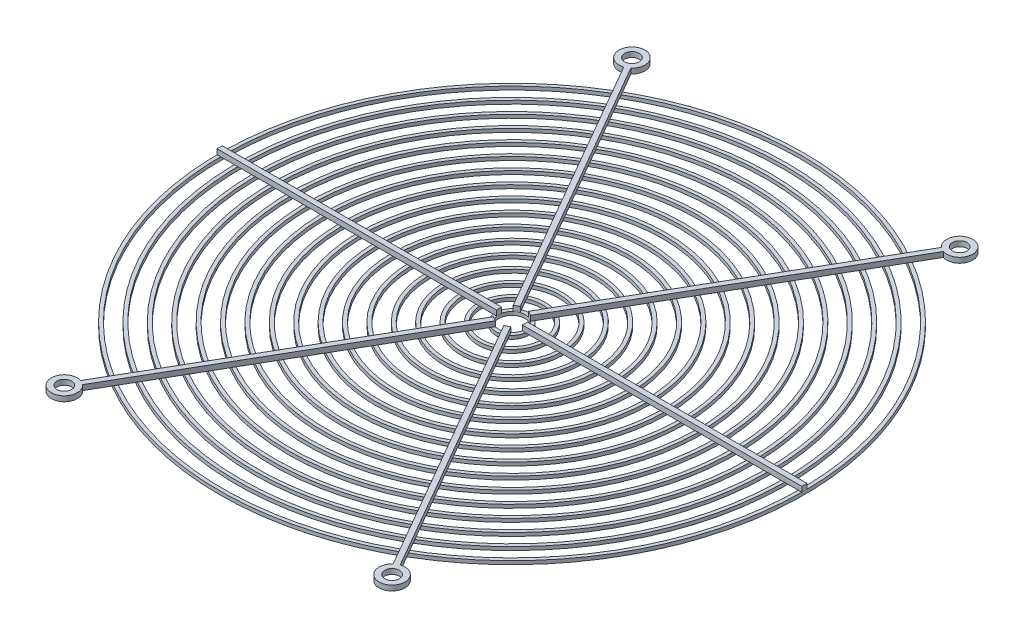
ISO-10303-21;
HEADER;
FILE_DESCRIPTION(('STEP AP214'),'2;1');
FILE_NAME('part.step','',(''),(''),'','','');
FILE_SCHEMA(('AUTOMOTIVE_DESIGN { 1 0 10303 214 1 1 1 1 }'));
ENDSEC;
DATA;
#1=APPLICATION_CONTEXT('core data for automotive mechanical design processes');
#2=APPLICATION_PROTOCOL_DEFINITION('international standard','automotive_design',2000,#1);
#3=PRODUCT_CONTEXT('',#1,'mechanical');
#4=PRODUCT('Part','Part','',(#3));
#5=PRODUCT_RELATED_PRODUCT_CATEGORY('part','',(#4));
#6=PRODUCT_DEFINITION_FORMATION('','',#4);
#7=PRODUCT_DEFINITION_CONTEXT('part definition',#1,'design');
#8=PRODUCT_DEFINITION('design','',#6,#7);
#9=PRODUCT_DEFINITION_SHAPE('','',#8);
#10=(LENGTH_UNIT() NAMED_UNIT(*) SI_UNIT(.MILLI.,.METRE.));
#11=(NAMED_UNIT(*) PLANE_ANGLE_UNIT() SI_UNIT($,.RADIAN.));
#12=(NAMED_UNIT(*) SI_UNIT($,.STERADIAN.) SOLID_ANGLE_UNIT());
#13=UNCERTAINTY_MEASURE_WITH_UNIT(LENGTH_MEASURE(1.E-05),#10,'distance_accuracy_value','');
#14=(GEOMETRIC_REPRESENTATION_CONTEXT(3) GLOBAL_UNCERTAINTY_ASSIGNED_CONTEXT((#13)) GLOBAL_UNIT_ASSIGNED_CONTEXT((#10,
#11,#12)) REPRESENTATION_CONTEXT('',''));
#15=CARTESIAN_POINT('',(0.,0.,0.));
#16=DIRECTION('',(0.,0.,1.));
#17=DIRECTION('',(1.,0.,0.));
#18=AXIS2_PLACEMENT_3D('',#15,#16,#17);
#19=CARTESIAN_POINT('',(95.0000000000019,5.,164.544826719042));
#20=DIRECTION('',(0.,1.,0.));
#21=DIRECTION('',(-0.866025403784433,0.,0.50000000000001));
#22=AXIS2_PLACEMENT_3D('',#19,#20,#21);
#23=PLANE('',#22);
#24=DIRECTION('',(-0.866025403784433,0.,0.50000000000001));
#25=VECTOR('',#24,1.);
#26=CARTESIAN_POINT('',(5.04903810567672,5.,5.74519052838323));
#27=LINE('',#26,#25);
#28=CARTESIAN_POINT('',(5.04903810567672,5.,5.74519052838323));
#29=VERTEX_POINT('',#28);
#30=CARTESIAN_POINT('',(2.45096189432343,5.,7.24519052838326));
#31=VERTEX_POINT('',#30);
#32=EDGE_CURVE('E123',#29,#31,#27,.T.);
#33=ORIENTED_EDGE('',*,*,#32,.T.);
#34=DIRECTION('',(0.50000000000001,0.,0.866025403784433));
#35=VECTOR('',#34,1.);
#36=CARTESIAN_POINT('',(2.45096189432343,5.,7.24519052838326));
#37=LINE('',#36,#35);
#38=CARTESIAN_POINT('',(90.0267272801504,5.,158.930865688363));
#39=VERTEX_POINT('',#38);
#40=EDGE_CURVE('E103',#31,#39,#37,.T.);
#41=ORIENTED_EDGE('',*,*,#40,.T.);
#42=CARTESIAN_POINT('',(95.0000000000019,5.,164.544826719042));
#43=DIRECTION('',(0.,1.,0.));
#44=DIRECTION('',(-0.866025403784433,0.,0.50000000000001));
#45=AXIS2_PLACEMENT_3D('',#42,#43,#44);
#46=CIRCLE('',#45,7.5);
#47=CARTESIAN_POINT('',(92.6248034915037,5.,157.430865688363));
#48=VERTEX_POINT('',#47);
#49=EDGE_CURVE('E68',#39,#48,#46,.T.);
#50=ORIENTED_EDGE('',*,*,#49,.T.);
#51=DIRECTION('',(-0.50000000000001,0.,-0.866025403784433));
#52=VECTOR('',#51,1.);
#53=CARTESIAN_POINT('',(5.04903810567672,5.,5.74519052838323));
#54=LINE('',#53,#52);
#55=EDGE_CURVE('E63',#48,#29,#54,.T.);
#56=ORIENTED_EDGE('',*,*,#55,.T.);
#57=EDGE_LOOP('',(#33,#41,#50,#56));
#58=FACE_BOUND('',#57,.T.);
#59=CARTESIAN_POINT('',(95.0000000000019,5.,164.544826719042));
#60=DIRECTION('',(0.,1.,0.));
#61=DIRECTION('',(-0.866025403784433,0.,0.50000000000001));
#62=AXIS2_PLACEMENT_3D('',#59,#60,#61);
#63=CIRCLE('',#62,4.25000000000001);
#64=CARTESIAN_POINT('',(91.3193920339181,5.,166.669826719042));
#65=VERTEX_POINT('',#64);
#66=EDGE_CURVE('E109',#65,#65,#63,.T.);
#67=ORIENTED_EDGE('',*,*,#66,.F.);
#68=EDGE_LOOP('',(#67));
#69=FACE_BOUND('',#68,.T.);
#70=ADVANCED_FACE('F47',(#58,#69),#23,.T.);
#71=CARTESIAN_POINT('',(95.0000000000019,2.,164.544826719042));
#72=DIRECTION('',(0.,1.,0.));
#73=DIRECTION('',(-0.866025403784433,0.,0.50000000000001));
#74=AXIS2_PLACEMENT_3D('',#71,#72,#73);
#75=PLANE('',#74);
#76=DIRECTION('',(-0.866025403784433,0.,0.50000000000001));
#77=VECTOR('',#76,1.);
#78=CARTESIAN_POINT('',(5.04903810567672,2.,5.74519052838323));
#79=LINE('',#78,#77);
#80=CARTESIAN_POINT('',(5.04903810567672,2.,5.74519052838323));
#81=VERTEX_POINT('',#80);
#82=CARTESIAN_POINT('',(2.45096189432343,2.,7.24519052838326));
#83=VERTEX_POINT('',#82);
#84=EDGE_CURVE('E94',#81,#83,#79,.T.);
#85=ORIENTED_EDGE('',*,*,#84,.F.);
#86=DIRECTION('',(-0.50000000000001,0.,-0.866025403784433));
#87=VECTOR('',#86,1.);
#88=CARTESIAN_POINT('',(5.04903810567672,2.,5.74519052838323));
#89=LINE('',#88,#87);
#90=CARTESIAN_POINT('',(92.6248034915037,2.,157.430865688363));
#91=VERTEX_POINT('',#90);
#92=EDGE_CURVE('E120',#91,#81,#89,.T.);
#93=ORIENTED_EDGE('',*,*,#92,.F.);
#94=CARTESIAN_POINT('',(95.0000000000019,2.,164.544826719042));
#95=DIRECTION('',(0.,1.,0.));
#96=DIRECTION('',(-0.866025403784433,0.,0.50000000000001));
#97=AXIS2_PLACEMENT_3D('',#94,#95,#96);
#98=CIRCLE('',#97,7.5);
#99=CARTESIAN_POINT('',(90.0267272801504,2.,158.930865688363));
#100=VERTEX_POINT('',#99);
#101=EDGE_CURVE('E95',#100,#91,#98,.T.);
#102=ORIENTED_EDGE('',*,*,#101,.F.);
#103=DIRECTION('',(0.50000000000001,0.,0.866025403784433));
#104=VECTOR('',#103,1.);
#105=CARTESIAN_POINT('',(2.45096189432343,2.,7.24519052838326));
#106=LINE('',#105,#104);
#107=EDGE_CURVE('E89',#83,#100,#106,.T.);
#108=ORIENTED_EDGE('',*,*,#107,.F.);
#109=EDGE_LOOP('',(#85,#93,#102,#108));
#110=FACE_BOUND('',#109,.T.);
#111=CARTESIAN_POINT('',(95.0000000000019,2.,164.544826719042));
#112=DIRECTION('',(0.,1.,0.));
#113=DIRECTION('',(-0.866025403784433,0.,0.50000000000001));
#114=AXIS2_PLACEMENT_3D('',#111,#112,#113);
#115=CIRCLE('',#114,4.25000000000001);
#116=CARTESIAN_POINT('',(91.3193920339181,2.,166.669826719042));
#117=VERTEX_POINT('',#116);
#118=EDGE_CURVE('E115',#117,#117,#115,.T.);
#119=ORIENTED_EDGE('',*,*,#118,.T.);
#120=EDGE_LOOP('',(#119));
#121=FACE_BOUND('',#120,.T.);
#122=ADVANCED_FACE('F90',(#110,#121),#75,.F.);
#123=CARTESIAN_POINT('',(5.04903810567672,5.,5.74519052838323));
#124=DIRECTION('',(0.50000000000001,0.,0.866025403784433));
#125=DIRECTION('',(0.866025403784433,0.,-0.50000000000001));
#126=AXIS2_PLACEMENT_3D('',#123,#124,#125);
#127=PLANE('',#126);
#128=ORIENTED_EDGE('',*,*,#84,.T.);
#129=DIRECTION('',(0.,-1.,0.));
#130=VECTOR('',#129,1.);
#131=CARTESIAN_POINT('',(2.45096189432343,5.,7.24519052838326));
#132=LINE('',#131,#130);
#133=EDGE_CURVE('E12',#31,#83,#132,.T.);
#134=ORIENTED_EDGE('',*,*,#133,.F.);
#135=ORIENTED_EDGE('',*,*,#32,.F.);
#136=DIRECTION('',(0.,-1.,0.));
#137=VECTOR('',#136,1.);
#138=CARTESIAN_POINT('',(5.04903810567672,5.,5.74519052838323));
#139=LINE('',#138,#137);
#140=EDGE_CURVE('E107',#29,#81,#139,.T.);
#141=ORIENTED_EDGE('',*,*,#140,.T.);
#142=EDGE_LOOP('',(#128,#134,#135,#141));
#143=FACE_BOUND('',#142,.T.);
#144=ADVANCED_FACE('F49',(#143),#127,.F.);
#145=CARTESIAN_POINT('',(2.45096189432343,5.,7.24519052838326));
#146=DIRECTION('',(0.866025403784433,0.,-0.50000000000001));
#147=DIRECTION('',(-0.50000000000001,0.,-0.866025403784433));
#148=AXIS2_PLACEMENT_3D('',#145,#146,#147);
#149=PLANE('',#148);
#150=ORIENTED_EDGE('',*,*,#107,.T.);
#151=DIRECTION('',(0.,-1.,0.));
#152=VECTOR('',#151,1.);
#153=CARTESIAN_POINT('',(90.0267272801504,5.,158.930865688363));
#154=LINE('',#153,#152);
#155=EDGE_CURVE('E56',#39,#100,#154,.T.);
#156=ORIENTED_EDGE('',*,*,#155,.F.);
#157=ORIENTED_EDGE('',*,*,#40,.F.);
#158=ORIENTED_EDGE('',*,*,#133,.T.);
#159=EDGE_LOOP('',(#150,#156,#157,#158));
#160=FACE_BOUND('',#159,.T.);
#161=ADVANCED_FACE('F102',(#160),#149,.F.);
#162=CARTESIAN_POINT('',(95.0000000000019,5.,164.544826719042));
#163=DIRECTION('',(0.,-1.,0.));
#164=DIRECTION('',(0.866025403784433,0.,-0.50000000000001));
#165=AXIS2_PLACEMENT_3D('',#162,#163,#164);
#166=CYLINDRICAL_SURFACE('',#165,7.5);
#167=ORIENTED_EDGE('',*,*,#101,.T.);
#168=DIRECTION('',(0.,-1.,0.));
#169=VECTOR('',#168,1.);
#170=CARTESIAN_POINT('',(92.6248034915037,5.,157.430865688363));
#171=LINE('',#170,#169);
#172=EDGE_CURVE('E134',#48,#91,#171,.T.);
#173=ORIENTED_EDGE('',*,*,#172,.F.);
#174=ORIENTED_EDGE('',*,*,#49,.F.);
#175=ORIENTED_EDGE('',*,*,#155,.T.);
#176=EDGE_LOOP('',(#167,#173,#174,#175));
#177=FACE_BOUND('',#176,.T.);
#178=ADVANCED_FACE('F138',(#177),#166,.T.);
#179=CARTESIAN_POINT('',(5.04903810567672,5.,5.74519052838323));
#180=DIRECTION('',(-0.866025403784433,0.,0.50000000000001));
#181=DIRECTION('',(0.50000000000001,0.,0.866025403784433));
#182=AXIS2_PLACEMENT_3D('',#179,#180,#181);
#183=PLANE('',#182);
#184=ORIENTED_EDGE('',*,*,#92,.T.);
#185=ORIENTED_EDGE('',*,*,#140,.F.);
#186=ORIENTED_EDGE('',*,*,#55,.F.);
#187=ORIENTED_EDGE('',*,*,#172,.T.);
#188=EDGE_LOOP('',(#184,#185,#186,#187));
#189=FACE_BOUND('',#188,.T.);
#190=ADVANCED_FACE('F140',(#189),#183,.F.);
#191=CARTESIAN_POINT('',(95.0000000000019,5.,164.544826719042));
#192=DIRECTION('',(0.,-1.,0.));
#193=DIRECTION('',(0.866025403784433,0.,-0.50000000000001));
#194=AXIS2_PLACEMENT_3D('',#191,#192,#193);
#195=CYLINDRICAL_SURFACE('',#194,4.25000000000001);
#196=ORIENTED_EDGE('',*,*,#66,.T.);
#197=EDGE_LOOP('',(#196));
#198=FACE_BOUND('',#197,.T.);
#199=ORIENTED_EDGE('',*,*,#118,.F.);
#200=EDGE_LOOP('',(#199));
#201=FACE_BOUND('',#200,.T.);
#202=ADVANCED_FACE('F146',(#198,#201),#195,.F.);
#203=CLOSED_SHELL('',(#70,#122,#144,#161,#178,#190,#202));
#204=MANIFOLD_SOLID_BREP('B2',#203);
#205=CARTESIAN_POINT('',(-94.9999999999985,5.,164.544826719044));
#206=DIRECTION('',(0.,1.,0.));
#207=DIRECTION('',(-0.866025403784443,0.,-0.499999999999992));
#208=AXIS2_PLACEMENT_3D('',#205,#206,#207);
#209=PLANE('',#208);
#210=DIRECTION('',(-0.866025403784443,0.,-0.499999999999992));
#211=VECTOR('',#210,1.);
#212=CARTESIAN_POINT('',(-2.45096189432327,5.,7.24519052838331));
#213=LINE('',#212,#211);
#214=CARTESIAN_POINT('',(-2.45096189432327,5.,7.24519052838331));
#215=VERTEX_POINT('',#214);
#216=CARTESIAN_POINT('',(-5.0490381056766,5.,5.74519052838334));
#217=VERTEX_POINT('',#216);
#218=EDGE_CURVE('E299',#215,#217,#213,.T.);
#219=ORIENTED_EDGE('',*,*,#218,.T.);
#220=DIRECTION('',(-0.499999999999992,0.,0.866025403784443));
#221=VECTOR('',#220,1.);
#222=CARTESIAN_POINT('',(-5.0490381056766,5.,5.74519052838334));
#223=LINE('',#222,#221);
#224=CARTESIAN_POINT('',(-92.6248034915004,5.,157.430865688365));
#225=VERTEX_POINT('',#224);
#226=EDGE_CURVE('E278',#217,#225,#223,.T.);
#227=ORIENTED_EDGE('',*,*,#226,.T.);
#228=CARTESIAN_POINT('',(-94.9999999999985,5.,164.544826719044));
#229=DIRECTION('',(0.,1.,0.));
#230=DIRECTION('',(-0.866025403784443,0.,-0.499999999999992));
#231=AXIS2_PLACEMENT_3D('',#228,#229,#230);
#232=CIRCLE('',#231,7.5);
#233=CARTESIAN_POINT('',(-90.0267272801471,5.,158.930865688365));
#234=VERTEX_POINT('',#233);
#235=EDGE_CURVE('E243',#225,#234,#232,.T.);
#236=ORIENTED_EDGE('',*,*,#235,.T.);
#237=DIRECTION('',(0.499999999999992,0.,-0.866025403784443));
#238=VECTOR('',#237,1.);
#239=CARTESIAN_POINT('',(-2.45096189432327,5.,7.24519052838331));
#240=LINE('',#239,#238);
#241=EDGE_CURVE('E238',#234,#215,#240,.T.);
#242=ORIENTED_EDGE('',*,*,#241,.T.);
#243=EDGE_LOOP('',(#219,#227,#236,#242));
#244=FACE_BOUND('',#243,.T.);
#245=CARTESIAN_POINT('',(-94.9999999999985,5.,164.544826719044));
#246=DIRECTION('',(0.,1.,0.));
#247=DIRECTION('',(-0.866025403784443,0.,-0.499999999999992));
#248=AXIS2_PLACEMENT_3D('',#245,#246,#247);
#249=CIRCLE('',#248,4.25000000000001);
#250=CARTESIAN_POINT('',(-98.6806079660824,5.,162.419826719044));
#251=VERTEX_POINT('',#250);
#252=EDGE_CURVE('E284',#251,#251,#249,.T.);
#253=ORIENTED_EDGE('',*,*,#252,.F.);
#254=EDGE_LOOP('',(#253));
#255=FACE_BOUND('',#254,.T.);
#256=ADVANCED_FACE('F222',(#244,#255),#209,.T.);
#257=CARTESIAN_POINT('',(-94.9999999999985,2.,164.544826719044));
#258=DIRECTION('',(0.,1.,0.));
#259=DIRECTION('',(-0.866025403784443,0.,-0.499999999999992));
#260=AXIS2_PLACEMENT_3D('',#257,#258,#259);
#261=PLANE('',#260);
#262=DIRECTION('',(-0.866025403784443,0.,-0.499999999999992));
#263=VECTOR('',#262,1.);
#264=CARTESIAN_POINT('',(-2.45096189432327,2.,7.24519052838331));
#265=LINE('',#264,#263);
#266=CARTESIAN_POINT('',(-2.45096189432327,2.,7.24519052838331));
#267=VERTEX_POINT('',#266);
#268=CARTESIAN_POINT('',(-5.0490381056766,2.,5.74519052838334));
#269=VERTEX_POINT('',#268);
#270=EDGE_CURVE('E269',#267,#269,#265,.T.);
#271=ORIENTED_EDGE('',*,*,#270,.F.);
#272=DIRECTION('',(0.499999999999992,0.,-0.866025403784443));
#273=VECTOR('',#272,1.);
#274=CARTESIAN_POINT('',(-2.45096189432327,2.,7.24519052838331));
#275=LINE('',#274,#273);
#276=CARTESIAN_POINT('',(-90.0267272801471,2.,158.930865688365));
#277=VERTEX_POINT('',#276);
#278=EDGE_CURVE('E296',#277,#267,#275,.T.);
#279=ORIENTED_EDGE('',*,*,#278,.F.);
#280=CARTESIAN_POINT('',(-94.9999999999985,2.,164.544826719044));
#281=DIRECTION('',(0.,1.,0.));
#282=DIRECTION('',(-0.866025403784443,0.,-0.499999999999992));
#283=AXIS2_PLACEMENT_3D('',#280,#281,#282);
#284=CIRCLE('',#283,7.5);
#285=CARTESIAN_POINT('',(-92.6248034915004,2.,157.430865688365));
#286=VERTEX_POINT('',#285);
#287=EDGE_CURVE('E270',#286,#277,#284,.T.);
#288=ORIENTED_EDGE('',*,*,#287,.F.);
#289=DIRECTION('',(-0.499999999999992,0.,0.866025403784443));
#290=VECTOR('',#289,1.);
#291=CARTESIAN_POINT('',(-5.0490381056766,2.,5.74519052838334));
#292=LINE('',#291,#290);
#293=EDGE_CURVE('E264',#269,#286,#292,.T.);
#294=ORIENTED_EDGE('',*,*,#293,.F.);
#295=EDGE_LOOP('',(#271,#279,#288,#294));
#296=FACE_BOUND('',#295,.T.);
#297=CARTESIAN_POINT('',(-94.9999999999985,2.,164.544826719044));
#298=DIRECTION('',(0.,1.,0.));
#299=DIRECTION('',(-0.866025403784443,0.,-0.499999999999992));
#300=AXIS2_PLACEMENT_3D('',#297,#298,#299);
#301=CIRCLE('',#300,4.25000000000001);
#302=CARTESIAN_POINT('',(-98.6806079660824,2.,162.419826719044));
#303=VERTEX_POINT('',#302);
#304=EDGE_CURVE('E290',#303,#303,#301,.T.);
#305=ORIENTED_EDGE('',*,*,#304,.T.);
#306=EDGE_LOOP('',(#305));
#307=FACE_BOUND('',#306,.T.);
#308=ADVANCED_FACE('F265',(#296,#307),#261,.F.);
#309=CARTESIAN_POINT('',(-2.45096189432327,5.,7.24519052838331));
#310=DIRECTION('',(-0.499999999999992,0.,0.866025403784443));
#311=DIRECTION('',(0.866025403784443,0.,0.499999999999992));
#312=AXIS2_PLACEMENT_3D('',#309,#310,#311);
#313=PLANE('',#312);
#314=ORIENTED_EDGE('',*,*,#270,.T.);
#315=DIRECTION('',(0.,-1.,0.));
#316=VECTOR('',#315,1.);
#317=CARTESIAN_POINT('',(-5.0490381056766,5.,5.74519052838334));
#318=LINE('',#317,#316);
#319=EDGE_CURVE('E45',#217,#269,#318,.T.);
#320=ORIENTED_EDGE('',*,*,#319,.F.);
#321=ORIENTED_EDGE('',*,*,#218,.F.);
#322=DIRECTION('',(0.,-1.,0.));
#323=VECTOR('',#322,1.);
#324=CARTESIAN_POINT('',(-2.45096189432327,5.,7.24519052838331));
#325=LINE('',#324,#323);
#326=EDGE_CURVE('E282',#215,#267,#325,.T.);
#327=ORIENTED_EDGE('',*,*,#326,.T.);
#328=EDGE_LOOP('',(#314,#320,#321,#327));
#329=FACE_BOUND('',#328,.T.);
#330=ADVANCED_FACE('F224',(#329),#313,.F.);
#331=CARTESIAN_POINT('',(-5.0490381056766,5.,5.74519052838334));
#332=DIRECTION('',(0.866025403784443,0.,0.499999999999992));
#333=DIRECTION('',(0.499999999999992,0.,-0.866025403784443));
#334=AXIS2_PLACEMENT_3D('',#331,#332,#333);
#335=PLANE('',#334);
#336=ORIENTED_EDGE('',*,*,#293,.T.);
#337=DIRECTION('',(0.,-1.,0.));
#338=VECTOR('',#337,1.);
#339=CARTESIAN_POINT('',(-92.6248034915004,5.,157.430865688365));
#340=LINE('',#339,#338);
#341=EDGE_CURVE('E231',#225,#286,#340,.T.);
#342=ORIENTED_EDGE('',*,*,#341,.F.);
#343=ORIENTED_EDGE('',*,*,#226,.F.);
#344=ORIENTED_EDGE('',*,*,#319,.T.);
#345=EDGE_LOOP('',(#336,#342,#343,#344));
#346=FACE_BOUND('',#345,.T.);
#347=ADVANCED_FACE('F277',(#346),#335,.F.);
#348=CARTESIAN_POINT('',(-94.9999999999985,5.,164.544826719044));
#349=DIRECTION('',(0.,-1.,0.));
#350=DIRECTION('',(0.866025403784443,0.,0.499999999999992));
#351=AXIS2_PLACEMENT_3D('',#348,#349,#350);
#352=CYLINDRICAL_SURFACE('',#351,7.5);
#353=ORIENTED_EDGE('',*,*,#287,.T.);
#354=DIRECTION('',(0.,-1.,0.));
#355=VECTOR('',#354,1.);
#356=CARTESIAN_POINT('',(-90.0267272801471,5.,158.930865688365));
#357=LINE('',#356,#355);
#358=EDGE_CURVE('E309',#234,#277,#357,.T.);
#359=ORIENTED_EDGE('',*,*,#358,.F.);
#360=ORIENTED_EDGE('',*,*,#235,.F.);
#361=ORIENTED_EDGE('',*,*,#341,.T.);
#362=EDGE_LOOP('',(#353,#359,#360,#361));
#363=FACE_BOUND('',#362,.T.);
#364=ADVANCED_FACE('F313',(#363),#352,.T.);
#365=CARTESIAN_POINT('',(-2.45096189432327,5.,7.24519052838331));
#366=DIRECTION('',(-0.866025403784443,0.,-0.499999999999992));
#367=DIRECTION('',(-0.499999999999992,0.,0.866025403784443));
#368=AXIS2_PLACEMENT_3D('',#365,#366,#367);
#369=PLANE('',#368);
#370=ORIENTED_EDGE('',*,*,#278,.T.);
#371=ORIENTED_EDGE('',*,*,#326,.F.);
#372=ORIENTED_EDGE('',*,*,#241,.F.);
#373=ORIENTED_EDGE('',*,*,#358,.T.);
#374=EDGE_LOOP('',(#370,#371,#372,#373));
#375=FACE_BOUND('',#374,.T.);
#376=ADVANCED_FACE('F315',(#375),#369,.F.);
#377=CARTESIAN_POINT('',(-94.9999999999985,5.,164.544826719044));
#378=DIRECTION('',(0.,-1.,0.));
#379=DIRECTION('',(0.866025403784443,0.,0.499999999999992));
#380=AXIS2_PLACEMENT_3D('',#377,#378,#379);
#381=CYLINDRICAL_SURFACE('',#380,4.25000000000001);
#382=ORIENTED_EDGE('',*,*,#252,.T.);
#383=EDGE_LOOP('',(#382));
#384=FACE_BOUND('',#383,.T.);
#385=ORIENTED_EDGE('',*,*,#304,.F.);
#386=EDGE_LOOP('',(#385));
#387=FACE_BOUND('',#386,.T.);
#388=ADVANCED_FACE('F321',(#384,#387),#381,.F.);
#389=CLOSED_SHELL('',(#256,#308,#330,#347,#364,#376,#388));
#390=MANIFOLD_SOLID_BREP('B6',#389);
#391=CARTESIAN_POINT('',(-190.,5.,1.32676367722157E-12));
#392=DIRECTION('',(0.,1.,0.));
#393=DIRECTION('',(0.,0.,-1.));
#394=AXIS2_PLACEMENT_3D('',#391,#392,#393);
#395=PLANE('',#394);
#396=CARTESIAN_POINT('',(0.,5.,0.));
#397=DIRECTION('',(0.,1.,0.));
#398=DIRECTION('',(0.,0.,1.));
#399=AXIS2_PLACEMENT_3D('',#396,#397,#398);
#400=CIRCLE('',#399,169.5);
#401=CARTESIAN_POINT('',(-169.493362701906,5.,1.50000000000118));
#402=VERTEX_POINT('',#401);
#403=CARTESIAN_POINT('',(-169.493362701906,5.,-1.49999999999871));
#404=VERTEX_POINT('',#403);
#405=EDGE_CURVE('E440',#402,#404,#400,.F.);
#406=ORIENTED_EDGE('',*,*,#405,.F.);
#407=DIRECTION('',(1.,0.,0.));
#408=VECTOR('',#407,1.);
#409=CARTESIAN_POINT('',(-7.49999999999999,5.,1.50000000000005));
#410=LINE('',#409,#408);
#411=CARTESIAN_POINT('',(-7.49999999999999,5.,1.50000000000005));
#412=VERTEX_POINT('',#411);
#413=EDGE_CURVE('E420',#402,#412,#410,.T.);
#414=ORIENTED_EDGE('',*,*,#413,.T.);
#415=DIRECTION('',(0.,0.,-1.));
#416=VECTOR('',#415,1.);
#417=CARTESIAN_POINT('',(-7.49999999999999,5.,1.50000000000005));
#418=LINE('',#417,#416);
#419=CARTESIAN_POINT('',(-7.50000000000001,5.,-1.49999999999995));
#420=VERTEX_POINT('',#419);
#421=EDGE_CURVE('E462',#412,#420,#418,.T.);
#422=ORIENTED_EDGE('',*,*,#421,.T.);
#423=DIRECTION('',(-1.,0.,0.));
#424=VECTOR('',#423,1.);
#425=CARTESIAN_POINT('',(-7.50000000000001,5.,-1.49999999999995));
#426=LINE('',#425,#424);
#427=EDGE_CURVE('E470',#420,#404,#426,.T.);
#428=ORIENTED_EDGE('',*,*,#427,.T.);
#429=EDGE_LOOP('',(#406,#414,#422,#428));
#430=FACE_BOUND('',#429,.T.);
#431=ADVANCED_FACE('F397',(#430),#395,.T.);
#432=CARTESIAN_POINT('',(-190.,2.,1.32676367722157E-12));
#433=DIRECTION('',(0.,1.,0.));
#434=DIRECTION('',(0.,0.,-1.));
#435=AXIS2_PLACEMENT_3D('',#432,#433,#434);
#436=PLANE('',#435);
#437=DIRECTION('',(1.,0.,0.));
#438=VECTOR('',#437,1.);
#439=CARTESIAN_POINT('',(-7.49999999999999,2.,1.50000000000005));
#440=LINE('',#439,#438);
#441=CARTESIAN_POINT('',(-169.493362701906,2.,1.50000000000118));
#442=VERTEX_POINT('',#441);
#443=CARTESIAN_POINT('',(-7.49999999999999,2.,1.50000000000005));
#444=VERTEX_POINT('',#443);
#445=EDGE_CURVE('E452',#442,#444,#440,.T.);
#446=ORIENTED_EDGE('',*,*,#445,.F.);
#447=CARTESIAN_POINT('',(0.,2.,0.));
#448=DIRECTION('',(0.,1.,0.));
#449=DIRECTION('',(0.,0.,-1.));
#450=AXIS2_PLACEMENT_3D('',#447,#448,#449);
#451=CIRCLE('',#450,169.5);
#452=CARTESIAN_POINT('',(-169.493362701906,2.,-1.49999999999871));
#453=VERTEX_POINT('',#452);
#454=EDGE_CURVE('E413',#453,#442,#451,.T.);
#455=ORIENTED_EDGE('',*,*,#454,.F.);
#456=DIRECTION('',(-1.,0.,0.));
#457=VECTOR('',#456,1.);
#458=CARTESIAN_POINT('',(-7.50000000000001,2.,-1.49999999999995));
#459=LINE('',#458,#457);
#460=CARTESIAN_POINT('',(-7.50000000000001,2.,-1.49999999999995));
#461=VERTEX_POINT('',#460);
#462=EDGE_CURVE('E450',#461,#453,#459,.T.);
#463=ORIENTED_EDGE('',*,*,#462,.F.);
#464=DIRECTION('',(0.,0.,-1.));
#465=VECTOR('',#464,1.);
#466=CARTESIAN_POINT('',(-7.49999999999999,2.,1.50000000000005));
#467=LINE('',#466,#465);
#468=EDGE_CURVE('E459',#444,#461,#467,.T.);
#469=ORIENTED_EDGE('',*,*,#468,.F.);
#470=EDGE_LOOP('',(#446,#455,#463,#469));
#471=FACE_BOUND('',#470,.T.);
#472=ADVANCED_FACE('F448',(#471),#436,.F.);
#473=CARTESIAN_POINT('',(-7.49999999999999,5.,1.50000000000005));
#474=DIRECTION('',(-1.,0.,0.));
#475=DIRECTION('',(0.,0.,1.));
#476=AXIS2_PLACEMENT_3D('',#473,#474,#475);
#477=PLANE('',#476);
#478=ORIENTED_EDGE('',*,*,#468,.T.);
#479=DIRECTION('',(0.,-1.,0.));
#480=VECTOR('',#479,1.);
#481=CARTESIAN_POINT('',(-7.50000000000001,5.,-1.49999999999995));
#482=LINE('',#481,#480);
#483=EDGE_CURVE('E406',#420,#461,#482,.T.);
#484=ORIENTED_EDGE('',*,*,#483,.F.);
#485=ORIENTED_EDGE('',*,*,#421,.F.);
#486=DIRECTION('',(0.,-1.,0.));
#487=VECTOR('',#486,1.);
#488=CARTESIAN_POINT('',(-7.49999999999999,5.,1.50000000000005));
#489=LINE('',#488,#487);
#490=EDGE_CURVE('E475',#412,#444,#489,.T.);
#491=ORIENTED_EDGE('',*,*,#490,.T.);
#492=EDGE_LOOP('',(#478,#484,#485,#491));
#493=FACE_BOUND('',#492,.T.);
#494=ADVANCED_FACE('F399',(#493),#477,.F.);
#495=CARTESIAN_POINT('',(-7.50000000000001,5.,-1.49999999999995));
#496=DIRECTION('',(0.,0.,1.));
#497=DIRECTION('',(1.,0.,0.));
#498=AXIS2_PLACEMENT_3D('',#495,#496,#497);
#499=PLANE('',#498);
#500=ORIENTED_EDGE('',*,*,#462,.T.);
#501=DIRECTION('',(0.,-1.,0.));
#502=VECTOR('',#501,1.);
#503=CARTESIAN_POINT('',(-169.493362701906,12.,-1.49999999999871));
#504=LINE('',#503,#502);
#505=EDGE_CURVE('E438',#404,#453,#504,.T.);
#506=ORIENTED_EDGE('',*,*,#505,.F.);
#507=ORIENTED_EDGE('',*,*,#427,.F.);
#508=ORIENTED_EDGE('',*,*,#483,.T.);
#509=EDGE_LOOP('',(#500,#506,#507,#508));
#510=FACE_BOUND('',#509,.T.);
#511=ADVANCED_FACE('F455',(#510),#499,.F.);
#512=CARTESIAN_POINT('',(-7.49999999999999,5.,1.50000000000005));
#513=DIRECTION('',(0.,0.,-1.));
#514=DIRECTION('',(-1.,0.,0.));
#515=AXIS2_PLACEMENT_3D('',#512,#513,#514);
#516=PLANE('',#515);
#517=ORIENTED_EDGE('',*,*,#413,.F.);
#518=DIRECTION('',(0.,-1.,0.));
#519=VECTOR('',#518,1.);
#520=CARTESIAN_POINT('',(-169.493362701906,12.,1.50000000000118));
#521=LINE('',#520,#519);
#522=EDGE_CURVE('E220',#402,#442,#521,.T.);
#523=ORIENTED_EDGE('',*,*,#522,.T.);
#524=ORIENTED_EDGE('',*,*,#445,.T.);
#525=ORIENTED_EDGE('',*,*,#490,.F.);
#526=EDGE_LOOP('',(#517,#523,#524,#525));
#527=FACE_BOUND('',#526,.T.);
#528=ADVANCED_FACE('F482',(#527),#516,.F.);
#529=CARTESIAN_POINT('',(0.,12.,0.));
#530=DIRECTION('',(0.,-1.,0.));
#531=DIRECTION('',(0.,0.,-1.));
#532=AXIS2_PLACEMENT_3D('',#529,#530,#531);
#533=CYLINDRICAL_SURFACE('',#532,169.5);
#534=ORIENTED_EDGE('',*,*,#405,.T.);
#535=ORIENTED_EDGE('',*,*,#505,.T.);
#536=ORIENTED_EDGE('',*,*,#454,.T.);
#537=ORIENTED_EDGE('',*,*,#522,.F.);
#538=EDGE_LOOP('',(#534,#535,#536,#537));
#539=FACE_BOUND('',#538,.T.);
#540=ADVANCED_FACE('F439',(#539),#533,.T.);
#541=CLOSED_SHELL('',(#431,#472,#494,#511,#528,#540));
#542=MANIFOLD_SOLID_BREP('B39',#541);
#543=CARTESIAN_POINT('',(-95.0000000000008,5.,-164.544826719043));
#544=DIRECTION('',(0.,1.,0.));
#545=DIRECTION('',(0.866025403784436,0.,-0.500000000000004));
#546=AXIS2_PLACEMENT_3D('',#543,#544,#545);
#547=PLANE('',#546);
#548=DIRECTION('',(0.866025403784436,0.,-0.500000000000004));
#549=VECTOR('',#548,1.);
#550=CARTESIAN_POINT('',(-5.04903810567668,5.,-5.74519052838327));
#551=LINE('',#550,#549);
#552=CARTESIAN_POINT('',(-5.04903810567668,5.,-5.74519052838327));
#553=VERTEX_POINT('',#552);
#554=CARTESIAN_POINT('',(-2.45096189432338,5.,-7.24519052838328));
#555=VERTEX_POINT('',#554);
#556=EDGE_CURVE('E625',#553,#555,#551,.T.);
#557=ORIENTED_EDGE('',*,*,#556,.T.);
#558=DIRECTION('',(-0.500000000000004,0.,-0.866025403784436));
#559=VECTOR('',#558,1.);
#560=CARTESIAN_POINT('',(-2.45096189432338,5.,-7.24519052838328));
#561=LINE('',#560,#559);
#562=CARTESIAN_POINT('',(-90.0267272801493,5.,-158.930865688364));
#563=VERTEX_POINT('',#562);
#564=EDGE_CURVE('E604',#555,#563,#561,.T.);
#565=ORIENTED_EDGE('',*,*,#564,.T.);
#566=CARTESIAN_POINT('',(-95.0000000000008,5.,-164.544826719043));
#567=DIRECTION('',(0.,1.,0.));
#568=DIRECTION('',(0.866025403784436,0.,-0.500000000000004));
#569=AXIS2_PLACEMENT_3D('',#566,#567,#568);
#570=CIRCLE('',#569,7.5);
#571=CARTESIAN_POINT('',(-92.6248034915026,5.,-157.430865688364));
#572=VERTEX_POINT('',#571);
#573=EDGE_CURVE('E569',#563,#572,#570,.T.);
#574=ORIENTED_EDGE('',*,*,#573,.T.);
#575=DIRECTION('',(0.500000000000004,0.,0.866025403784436));
#576=VECTOR('',#575,1.);
#577=CARTESIAN_POINT('',(-5.04903810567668,5.,-5.74519052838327));
#578=LINE('',#577,#576);
#579=EDGE_CURVE('E564',#572,#553,#578,.T.);
#580=ORIENTED_EDGE('',*,*,#579,.T.);
#581=EDGE_LOOP('',(#557,#565,#574,#580));
#582=FACE_BOUND('',#581,.T.);
#583=CARTESIAN_POINT('',(-95.0000000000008,5.,-164.544826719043));
#584=DIRECTION('',(0.,1.,0.));
#585=DIRECTION('',(0.866025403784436,0.,-0.500000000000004));
#586=AXIS2_PLACEMENT_3D('',#583,#584,#585);
#587=CIRCLE('',#586,4.25000000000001);
#588=CARTESIAN_POINT('',(-91.3193920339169,5.,-166.669826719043));
#589=VERTEX_POINT('',#588);
#590=EDGE_CURVE('E610',#589,#589,#587,.T.);
#591=ORIENTED_EDGE('',*,*,#590,.F.);
#592=EDGE_LOOP('',(#591));
#593=FACE_BOUND('',#592,.T.);
#594=ADVANCED_FACE('F548',(#582,#593),#547,.T.);
#595=CARTESIAN_POINT('',(-95.0000000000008,2.,-164.544826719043));
#596=DIRECTION('',(0.,1.,0.));
#597=DIRECTION('',(0.866025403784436,0.,-0.500000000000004));
#598=AXIS2_PLACEMENT_3D('',#595,#596,#597);
#599=PLANE('',#598);
#600=DIRECTION('',(0.866025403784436,0.,-0.500000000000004));
#601=VECTOR('',#600,1.);
#602=CARTESIAN_POINT('',(-5.04903810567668,2.,-5.74519052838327));
#603=LINE('',#602,#601);
#604=CARTESIAN_POINT('',(-5.04903810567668,2.,-5.74519052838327));
#605=VERTEX_POINT('',#604);
#606=CARTESIAN_POINT('',(-2.45096189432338,2.,-7.24519052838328));
#607=VERTEX_POINT('',#606);
#608=EDGE_CURVE('E595',#605,#607,#603,.T.);
#609=ORIENTED_EDGE('',*,*,#608,.F.);
#610=DIRECTION('',(0.500000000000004,0.,0.866025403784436));
#611=VECTOR('',#610,1.);
#612=CARTESIAN_POINT('',(-5.04903810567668,2.,-5.74519052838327));
#613=LINE('',#612,#611);
#614=CARTESIAN_POINT('',(-92.6248034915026,2.,-157.430865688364));
#615=VERTEX_POINT('',#614);
#616=EDGE_CURVE('E622',#615,#605,#613,.T.);
#617=ORIENTED_EDGE('',*,*,#616,.F.);
#618=CARTESIAN_POINT('',(-95.0000000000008,2.,-164.544826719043));
#619=DIRECTION('',(0.,1.,0.));
#620=DIRECTION('',(0.866025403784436,0.,-0.500000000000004));
#621=AXIS2_PLACEMENT_3D('',#618,#619,#620);
#622=CIRCLE('',#621,7.5);
#623=CARTESIAN_POINT('',(-90.0267272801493,2.,-158.930865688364));
#624=VERTEX_POINT('',#623);
#625=EDGE_CURVE('E596',#624,#615,#622,.T.);
#626=ORIENTED_EDGE('',*,*,#625,.F.);
#627=DIRECTION('',(-0.500000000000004,0.,-0.866025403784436));
#628=VECTOR('',#627,1.);
#629=CARTESIAN_POINT('',(-2.45096189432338,2.,-7.24519052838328));
#630=LINE('',#629,#628);
#631=EDGE_CURVE('E590',#607,#624,#630,.T.);
#632=ORIENTED_EDGE('',*,*,#631,.F.);
#633=EDGE_LOOP('',(#609,#617,#626,#632));
#634=FACE_BOUND('',#633,.T.);
#635=CARTESIAN_POINT('',(-95.0000000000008,2.,-164.544826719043));
#636=DIRECTION('',(0.,1.,0.));
#637=DIRECTION('',(0.866025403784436,0.,-0.500000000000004));
#638=AXIS2_PLACEMENT_3D('',#635,#636,#637);
#639=CIRCLE('',#638,4.25000000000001);
#640=CARTESIAN_POINT('',(-91.3193920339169,2.,-166.669826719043));
#641=VERTEX_POINT('',#640);
#642=EDGE_CURVE('E616',#641,#641,#639,.T.);
#643=ORIENTED_EDGE('',*,*,#642,.T.);
#644=EDGE_LOOP('',(#643));
#645=FACE_BOUND('',#644,.T.);
#646=ADVANCED_FACE('F591',(#634,#645),#599,.F.);
#647=CARTESIAN_POINT('',(-5.04903810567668,5.,-5.74519052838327));
#648=DIRECTION('',(-0.500000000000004,0.,-0.866025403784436));
#649=DIRECTION('',(-0.866025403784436,0.,0.500000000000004));
#650=AXIS2_PLACEMENT_3D('',#647,#648,#649);
#651=PLANE('',#650);
#652=ORIENTED_EDGE('',*,*,#608,.T.);
#653=DIRECTION('',(0.,-1.,0.));
#654=VECTOR('',#653,1.);
#655=CARTESIAN_POINT('',(-2.45096189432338,5.,-7.24519052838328));
#656=LINE('',#655,#654);
#657=EDGE_CURVE('E395',#555,#607,#656,.T.);
#658=ORIENTED_EDGE('',*,*,#657,.F.);
#659=ORIENTED_EDGE('',*,*,#556,.F.);
#660=DIRECTION('',(0.,-1.,0.));
#661=VECTOR('',#660,1.);
#662=CARTESIAN_POINT('',(-5.04903810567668,5.,-5.74519052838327));
#663=LINE('',#662,#661);
#664=EDGE_CURVE('E608',#553,#605,#663,.T.);
#665=ORIENTED_EDGE('',*,*,#664,.T.);
#666=EDGE_LOOP('',(#652,#658,#659,#665));
#667=FACE_BOUND('',#666,.T.);
#668=ADVANCED_FACE('F550',(#667),#651,.F.);
#669=CARTESIAN_POINT('',(-2.45096189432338,5.,-7.24519052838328));
#670=DIRECTION('',(-0.866025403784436,0.,0.500000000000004));
#671=DIRECTION('',(0.500000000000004,0.,0.866025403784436));
#672=AXIS2_PLACEMENT_3D('',#669,#670,#671);
#673=PLANE('',#672);
#674=ORIENTED_EDGE('',*,*,#631,.T.);
#675=DIRECTION('',(0.,-1.,0.));
#676=VECTOR('',#675,1.);
#677=CARTESIAN_POINT('',(-90.0267272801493,5.,-158.930865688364));
#678=LINE('',#677,#676);
#679=EDGE_CURVE('E557',#563,#624,#678,.T.);
#680=ORIENTED_EDGE('',*,*,#679,.F.);
#681=ORIENTED_EDGE('',*,*,#564,.F.);
#682=ORIENTED_EDGE('',*,*,#657,.T.);
#683=EDGE_LOOP('',(#674,#680,#681,#682));
#684=FACE_BOUND('',#683,.T.);
#685=ADVANCED_FACE('F603',(#684),#673,.F.);
#686=CARTESIAN_POINT('',(-95.0000000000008,5.,-164.544826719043));
#687=DIRECTION('',(0.,-1.,0.));
#688=DIRECTION('',(-0.866025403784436,0.,0.500000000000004));
#689=AXIS2_PLACEMENT_3D('',#686,#687,#688);
#690=CYLINDRICAL_SURFACE('',#689,7.5);
#691=ORIENTED_EDGE('',*,*,#625,.T.);
#692=DIRECTION('',(0.,-1.,0.));
#693=VECTOR('',#692,1.);
#694=CARTESIAN_POINT('',(-92.6248034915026,5.,-157.430865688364));
#695=LINE('',#694,#693);
#696=EDGE_CURVE('E634',#572,#615,#695,.T.);
#697=ORIENTED_EDGE('',*,*,#696,.F.);
#698=ORIENTED_EDGE('',*,*,#573,.F.);
#699=ORIENTED_EDGE('',*,*,#679,.T.);
#700=EDGE_LOOP('',(#691,#697,#698,#699));
#701=FACE_BOUND('',#700,.T.);
#702=ADVANCED_FACE('F639',(#701),#690,.T.);
#703=CARTESIAN_POINT('',(-5.04903810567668,5.,-5.74519052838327));
#704=DIRECTION('',(0.866025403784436,0.,-0.500000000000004));
#705=DIRECTION('',(-0.500000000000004,0.,-0.866025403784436));
#706=AXIS2_PLACEMENT_3D('',#703,#704,#705);
#707=PLANE('',#706);
#708=ORIENTED_EDGE('',*,*,#616,.T.);
#709=ORIENTED_EDGE('',*,*,#664,.F.);
#710=ORIENTED_EDGE('',*,*,#579,.F.);
#711=ORIENTED_EDGE('',*,*,#696,.T.);
#712=EDGE_LOOP('',(#708,#709,#710,#711));
#713=FACE_BOUND('',#712,.T.);
#714=ADVANCED_FACE('F641',(#713),#707,.F.);
#715=CARTESIAN_POINT('',(-95.0000000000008,5.,-164.544826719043));
#716=DIRECTION('',(0.,-1.,0.));
#717=DIRECTION('',(-0.866025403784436,0.,0.500000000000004));
#718=AXIS2_PLACEMENT_3D('',#715,#716,#717);
#719=CYLINDRICAL_SURFACE('',#718,4.25000000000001);
#720=ORIENTED_EDGE('',*,*,#590,.T.);
#721=EDGE_LOOP('',(#720));
#722=FACE_BOUND('',#721,.T.);
#723=ORIENTED_EDGE('',*,*,#642,.F.);
#724=EDGE_LOOP('',(#723));
#725=FACE_BOUND('',#724,.T.);
#726=ADVANCED_FACE('F647',(#722,#725),#719,.F.);
#727=CLOSED_SHELL('',(#594,#646,#668,#685,#702,#714,#726));
#728=MANIFOLD_SOLID_BREP('B214',#727);
#729=CARTESIAN_POINT('',(94.9999999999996,5.,-164.544826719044));
#730=DIRECTION('',(0.,1.,0.));
#731=DIRECTION('',(0.86602540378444,0.,0.499999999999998));
#732=AXIS2_PLACEMENT_3D('',#729,#730,#731);
#733=PLANE('',#732);
#734=DIRECTION('',(0.86602540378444,0.,0.499999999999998));
#735=VECTOR('',#734,1.);
#736=CARTESIAN_POINT('',(2.45096189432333,5.,-7.2451905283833));
#737=LINE('',#736,#735);
#738=CARTESIAN_POINT('',(2.45096189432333,5.,-7.2451905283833));
#739=VERTEX_POINT('',#738);
#740=CARTESIAN_POINT('',(5.04903810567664,5.,-5.7451905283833));
#741=VERTEX_POINT('',#740);
#742=EDGE_CURVE('E799',#739,#741,#737,.T.);
#743=ORIENTED_EDGE('',*,*,#742,.T.);
#744=DIRECTION('',(0.499999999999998,0.,-0.86602540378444));
#745=VECTOR('',#744,1.);
#746=CARTESIAN_POINT('',(5.04903810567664,5.,-5.7451905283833));
#747=LINE('',#746,#745);
#748=CARTESIAN_POINT('',(92.6248034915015,5.,-157.430865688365));
#749=VERTEX_POINT('',#748);
#750=EDGE_CURVE('E779',#741,#749,#747,.T.);
#751=ORIENTED_EDGE('',*,*,#750,.T.);
#752=CARTESIAN_POINT('',(94.9999999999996,5.,-164.544826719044));
#753=DIRECTION('',(0.,1.,0.));
#754=DIRECTION('',(0.86602540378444,0.,0.499999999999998));
#755=AXIS2_PLACEMENT_3D('',#752,#753,#754);
#756=CIRCLE('',#755,7.5);
#757=CARTESIAN_POINT('',(90.0267272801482,5.,-158.930865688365));
#758=VERTEX_POINT('',#757);
#759=EDGE_CURVE('E744',#749,#758,#756,.T.);
#760=ORIENTED_EDGE('',*,*,#759,.T.);
#761=DIRECTION('',(-0.499999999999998,0.,0.86602540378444));
#762=VECTOR('',#761,1.);
#763=CARTESIAN_POINT('',(2.45096189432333,5.,-7.2451905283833));
#764=LINE('',#763,#762);
#765=EDGE_CURVE('E739',#758,#739,#764,.T.);
#766=ORIENTED_EDGE('',*,*,#765,.T.);
#767=EDGE_LOOP('',(#743,#751,#760,#766));
#768=FACE_BOUND('',#767,.T.);
#769=CARTESIAN_POINT('',(94.9999999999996,5.,-164.544826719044));
#770=DIRECTION('',(0.,1.,0.));
#771=DIRECTION('',(0.86602540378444,0.,0.499999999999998));
#772=AXIS2_PLACEMENT_3D('',#769,#770,#771);
#773=CIRCLE('',#772,4.25000000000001);
#774=CARTESIAN_POINT('',(98.6806079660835,5.,-162.419826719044));
#775=VERTEX_POINT('',#774);
#776=EDGE_CURVE('E785',#775,#775,#773,.T.);
#777=ORIENTED_EDGE('',*,*,#776,.F.);
#778=EDGE_LOOP('',(#777));
#779=FACE_BOUND('',#778,.T.);
#780=ADVANCED_FACE('F723',(#768,#779),#733,.T.);
#781=CARTESIAN_POINT('',(94.9999999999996,2.,-164.544826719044));
#782=DIRECTION('',(0.,1.,0.));
#783=DIRECTION('',(0.86602540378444,0.,0.499999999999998));
#784=AXIS2_PLACEMENT_3D('',#781,#782,#783);
#785=PLANE('',#784);
#786=DIRECTION('',(0.86602540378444,0.,0.499999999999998));
#787=VECTOR('',#786,1.);
#788=CARTESIAN_POINT('',(2.45096189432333,2.,-7.2451905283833));
#789=LINE('',#788,#787);
#790=CARTESIAN_POINT('',(2.45096189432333,2.,-7.2451905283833));
#791=VERTEX_POINT('',#790);
#792=CARTESIAN_POINT('',(5.04903810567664,2.,-5.7451905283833));
#793=VERTEX_POINT('',#792);
#794=EDGE_CURVE('E770',#791,#793,#789,.T.);
#795=ORIENTED_EDGE('',*,*,#794,.F.);
#796=DIRECTION('',(-0.499999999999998,0.,0.86602540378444));
#797=VECTOR('',#796,1.);
#798=CARTESIAN_POINT('',(2.45096189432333,2.,-7.2451905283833));
#799=LINE('',#798,#797);
#800=CARTESIAN_POINT('',(90.0267272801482,2.,-158.930865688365));
#801=VERTEX_POINT('',#800);
#802=EDGE_CURVE('E796',#801,#791,#799,.T.);
#803=ORIENTED_EDGE('',*,*,#802,.F.);
#804=CARTESIAN_POINT('',(94.9999999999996,2.,-164.544826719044));
#805=DIRECTION('',(0.,1.,0.));
#806=DIRECTION('',(0.86602540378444,0.,0.499999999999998));
#807=AXIS2_PLACEMENT_3D('',#804,#805,#806);
#808=CIRCLE('',#807,7.5);
#809=CARTESIAN_POINT('',(92.6248034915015,2.,-157.430865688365));
#810=VERTEX_POINT('',#809);
#811=EDGE_CURVE('E771',#810,#801,#808,.T.);
#812=ORIENTED_EDGE('',*,*,#811,.F.);
#813=DIRECTION('',(0.499999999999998,0.,-0.86602540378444));
#814=VECTOR('',#813,1.);
#815=CARTESIAN_POINT('',(5.04903810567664,2.,-5.7451905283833));
#816=LINE('',#815,#814);
#817=EDGE_CURVE('E765',#793,#810,#816,.T.);
#818=ORIENTED_EDGE('',*,*,#817,.F.);
#819=EDGE_LOOP('',(#795,#803,#812,#818));
#820=FACE_BOUND('',#819,.T.);
#821=CARTESIAN_POINT('',(94.9999999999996,2.,-164.544826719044));
#822=DIRECTION('',(0.,1.,0.));
#823=DIRECTION('',(0.86602540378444,0.,0.499999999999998));
#824=AXIS2_PLACEMENT_3D('',#821,#822,#823);
#825=CIRCLE('',#824,4.25000000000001);
#826=CARTESIAN_POINT('',(98.6806079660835,2.,-162.419826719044));
#827=VERTEX_POINT('',#826);
#828=EDGE_CURVE('E791',#827,#827,#825,.T.);
#829=ORIENTED_EDGE('',*,*,#828,.T.);
#830=EDGE_LOOP('',(#829));
#831=FACE_BOUND('',#830,.T.);
#832=ADVANCED_FACE('F766',(#820,#831),#785,.F.);
#833=CARTESIAN_POINT('',(2.45096189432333,5.,-7.2451905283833));
#834=DIRECTION('',(0.499999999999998,0.,-0.86602540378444));
#835=DIRECTION('',(-0.86602540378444,0.,-0.499999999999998));
#836=AXIS2_PLACEMENT_3D('',#833,#834,#835);
#837=PLANE('',#836);
#838=ORIENTED_EDGE('',*,*,#794,.T.);
#839=DIRECTION('',(0.,-1.,0.));
#840=VECTOR('',#839,1.);
#841=CARTESIAN_POINT('',(5.04903810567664,5.,-5.7451905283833));
#842=LINE('',#841,#840);
#843=EDGE_CURVE('E546',#741,#793,#842,.T.);
#844=ORIENTED_EDGE('',*,*,#843,.F.);
#845=ORIENTED_EDGE('',*,*,#742,.F.);
#846=DIRECTION('',(0.,-1.,0.));
#847=VECTOR('',#846,1.);
#848=CARTESIAN_POINT('',(2.45096189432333,5.,-7.2451905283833));
#849=LINE('',#848,#847);
#850=EDGE_CURVE('E783',#739,#791,#849,.T.);
#851=ORIENTED_EDGE('',*,*,#850,.T.);
#852=EDGE_LOOP('',(#838,#844,#845,#851));
#853=FACE_BOUND('',#852,.T.);
#854=ADVANCED_FACE('F725',(#853),#837,.F.);
#855=CARTESIAN_POINT('',(5.04903810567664,5.,-5.7451905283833));
#856=DIRECTION('',(-0.86602540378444,0.,-0.499999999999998));
#857=DIRECTION('',(-0.499999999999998,0.,0.86602540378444));
#858=AXIS2_PLACEMENT_3D('',#855,#856,#857);
#859=PLANE('',#858);
#860=ORIENTED_EDGE('',*,*,#817,.T.);
#861=DIRECTION('',(0.,-1.,0.));
#862=VECTOR('',#861,1.);
#863=CARTESIAN_POINT('',(92.6248034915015,5.,-157.430865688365));
#864=LINE('',#863,#862);
#865=EDGE_CURVE('E732',#749,#810,#864,.T.);
#866=ORIENTED_EDGE('',*,*,#865,.F.);
#867=ORIENTED_EDGE('',*,*,#750,.F.);
#868=ORIENTED_EDGE('',*,*,#843,.T.);
#869=EDGE_LOOP('',(#860,#866,#867,#868));
#870=FACE_BOUND('',#869,.T.);
#871=ADVANCED_FACE('F778',(#870),#859,.F.);
#872=CARTESIAN_POINT('',(94.9999999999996,5.,-164.544826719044));
#873=DIRECTION('',(0.,-1.,0.));
#874=DIRECTION('',(-0.86602540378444,0.,-0.499999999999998));
#875=AXIS2_PLACEMENT_3D('',#872,#873,#874);
#876=CYLINDRICAL_SURFACE('',#875,7.5);
#877=ORIENTED_EDGE('',*,*,#811,.T.);
#878=DIRECTION('',(0.,-1.,0.));
#879=VECTOR('',#878,1.);
#880=CARTESIAN_POINT('',(90.0267272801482,5.,-158.930865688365));
#881=LINE('',#880,#879);
#882=EDGE_CURVE('E809',#758,#801,#881,.T.);
#883=ORIENTED_EDGE('',*,*,#882,.F.);
#884=ORIENTED_EDGE('',*,*,#759,.F.);
#885=ORIENTED_EDGE('',*,*,#865,.T.);
#886=EDGE_LOOP('',(#877,#883,#884,#885));
#887=FACE_BOUND('',#886,.T.);
#888=ADVANCED_FACE('F814',(#887),#876,.T.);
#889=CARTESIAN_POINT('',(2.45096189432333,5.,-7.2451905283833));
#890=DIRECTION('',(0.86602540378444,0.,0.499999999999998));
#891=DIRECTION('',(0.499999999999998,0.,-0.86602540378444));
#892=AXIS2_PLACEMENT_3D('',#889,#890,#891);
#893=PLANE('',#892);
#894=ORIENTED_EDGE('',*,*,#802,.T.);
#895=ORIENTED_EDGE('',*,*,#850,.F.);
#896=ORIENTED_EDGE('',*,*,#765,.F.);
#897=ORIENTED_EDGE('',*,*,#882,.T.);
#898=EDGE_LOOP('',(#894,#895,#896,#897));
#899=FACE_BOUND('',#898,.T.);
#900=ADVANCED_FACE('F816',(#899),#893,.F.);
#901=CARTESIAN_POINT('',(94.9999999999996,5.,-164.544826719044));
#902=DIRECTION('',(0.,-1.,0.));
#903=DIRECTION('',(-0.86602540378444,0.,-0.499999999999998));
#904=AXIS2_PLACEMENT_3D('',#901,#902,#903);
#905=CYLINDRICAL_SURFACE('',#904,4.25000000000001);
#906=ORIENTED_EDGE('',*,*,#776,.T.);
#907=EDGE_LOOP('',(#906));
#908=FACE_BOUND('',#907,.T.);
#909=ORIENTED_EDGE('',*,*,#828,.F.);
#910=EDGE_LOOP('',(#909));
#911=FACE_BOUND('',#910,.T.);
#912=ADVANCED_FACE('F822',(#908,#911),#905,.F.);
#913=CLOSED_SHELL('',(#780,#832,#854,#871,#888,#900,#912));
#914=MANIFOLD_SOLID_BREP('B389',#913);
#915=CARTESIAN_POINT('',(190.,5.,0.));
#916=DIRECTION('',(0.,1.,0.));
#917=DIRECTION('',(0.,0.,1.));
#918=AXIS2_PLACEMENT_3D('',#915,#916,#917);
#919=PLANE('',#918);
#920=DIRECTION('',(0.,0.,1.));
#921=VECTOR('',#920,1.);
#922=CARTESIAN_POINT('',(169.5,5.,0.));
#923=LINE('',#922,#921);
#924=CARTESIAN_POINT('',(169.5,5.,-1.49999999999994));
#925=VERTEX_POINT('',#924);
#926=CARTESIAN_POINT('',(169.5,5.,1.50000000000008));
#927=VERTEX_POINT('',#926);
#928=EDGE_CURVE('E941',#925,#927,#923,.T.);
#929=ORIENTED_EDGE('',*,*,#928,.F.);
#930=DIRECTION('',(-1.,0.,0.));
#931=VECTOR('',#930,1.);
#932=CARTESIAN_POINT('',(7.5,5.,-1.5));
#933=LINE('',#932,#931);
#934=CARTESIAN_POINT('',(7.5,5.,-1.5));
#935=VERTEX_POINT('',#934);
#936=EDGE_CURVE('E921',#925,#935,#933,.T.);
#937=ORIENTED_EDGE('',*,*,#936,.T.);
#938=DIRECTION('',(0.,0.,1.));
#939=VECTOR('',#938,1.);
#940=CARTESIAN_POINT('',(7.5,5.,-1.5));
#941=LINE('',#940,#939);
#942=CARTESIAN_POINT('',(7.5,5.,1.5));
#943=VERTEX_POINT('',#942);
#944=EDGE_CURVE('E964',#935,#943,#941,.T.);
#945=ORIENTED_EDGE('',*,*,#944,.T.);
#946=DIRECTION('',(1.,0.,0.));
#947=VECTOR('',#946,1.);
#948=CARTESIAN_POINT('',(7.5,5.,1.5));
#949=LINE('',#948,#947);
#950=EDGE_CURVE('E972',#943,#927,#949,.T.);
#951=ORIENTED_EDGE('',*,*,#950,.T.);
#952=EDGE_LOOP('',(#929,#937,#945,#951));
#953=FACE_BOUND('',#952,.T.);
#954=ADVANCED_FACE('F898',(#953),#919,.T.);
#955=CARTESIAN_POINT('',(190.,2.,0.));
#956=DIRECTION('',(0.,1.,0.));
#957=DIRECTION('',(0.,0.,1.));
#958=AXIS2_PLACEMENT_3D('',#955,#956,#957);
#959=PLANE('',#958);
#960=DIRECTION('',(-1.,0.,0.));
#961=VECTOR('',#960,1.);
#962=CARTESIAN_POINT('',(7.5,2.,-1.5));
#963=LINE('',#962,#961);
#964=CARTESIAN_POINT('',(169.5,2.,-1.5));
#965=VERTEX_POINT('',#964);
#966=CARTESIAN_POINT('',(7.5,2.,-1.5));
#967=VERTEX_POINT('',#966);
#968=EDGE_CURVE('E953',#965,#967,#963,.T.);
#969=ORIENTED_EDGE('',*,*,#968,.F.);
#970=DIRECTION('',(0.,0.,-1.));
#971=VECTOR('',#970,1.);
#972=CARTESIAN_POINT('',(169.5,2.,1.50000000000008));
#973=LINE('',#972,#971);
#974=CARTESIAN_POINT('',(169.5,2.,1.50000000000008));
#975=VERTEX_POINT('',#974);
#976=EDGE_CURVE('E914',#975,#965,#973,.T.);
#977=ORIENTED_EDGE('',*,*,#976,.F.);
#978=DIRECTION('',(1.,0.,0.));
#979=VECTOR('',#978,1.);
#980=CARTESIAN_POINT('',(7.5,2.,1.5));
#981=LINE('',#980,#979);
#982=CARTESIAN_POINT('',(7.5,2.,1.5));
#983=VERTEX_POINT('',#982);
#984=EDGE_CURVE('E951',#983,#975,#981,.T.);
#985=ORIENTED_EDGE('',*,*,#984,.F.);
#986=DIRECTION('',(0.,0.,1.));
#987=VECTOR('',#986,1.);
#988=CARTESIAN_POINT('',(7.5,2.,-1.5));
#989=LINE('',#988,#987);
#990=EDGE_CURVE('E960',#967,#983,#989,.T.);
#991=ORIENTED_EDGE('',*,*,#990,.F.);
#992=EDGE_LOOP('',(#969,#977,#985,#991));
#993=FACE_BOUND('',#992,.T.);
#994=ADVANCED_FACE('F949',(#993),#959,.F.);
#995=CARTESIAN_POINT('',(7.5,5.,-1.5));
#996=DIRECTION('',(1.,0.,0.));
#997=DIRECTION('',(0.,0.,-1.));
#998=AXIS2_PLACEMENT_3D('',#995,#996,#997);
#999=PLANE('',#998);
#1000=ORIENTED_EDGE('',*,*,#990,.T.);
#1001=DIRECTION('',(0.,-1.,0.));
#1002=VECTOR('',#1001,1.);
#1003=CARTESIAN_POINT('',(7.5,5.,1.5));
#1004=LINE('',#1003,#1002);
#1005=EDGE_CURVE('E907',#943,#983,#1004,.T.);
#1006=ORIENTED_EDGE('',*,*,#1005,.F.);
#1007=ORIENTED_EDGE('',*,*,#944,.F.);
#1008=DIRECTION('',(0.,-1.,0.));
#1009=VECTOR('',#1008,1.);
#1010=CARTESIAN_POINT('',(7.5,5.,-1.5));
#1011=LINE('',#1010,#1009);
#1012=EDGE_CURVE('E977',#935,#967,#1011,.T.);
#1013=ORIENTED_EDGE('',*,*,#1012,.T.);
#1014=EDGE_LOOP('',(#1000,#1006,#1007,#1013));
#1015=FACE_BOUND('',#1014,.T.);
#1016=ADVANCED_FACE('F900',(#1015),#999,.F.);
#1017=CARTESIAN_POINT('',(7.5,5.,1.5));
#1018=DIRECTION('',(0.,0.,-1.));
#1019=DIRECTION('',(-1.,0.,0.));
#1020=AXIS2_PLACEMENT_3D('',#1017,#1018,#1019);
#1021=PLANE('',#1020);
#1022=ORIENTED_EDGE('',*,*,#984,.T.);
#1023=DIRECTION('',(0.,-1.,0.));
#1024=VECTOR('',#1023,1.);
#1025=CARTESIAN_POINT('',(169.5,12.,1.50000000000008));
#1026=LINE('',#1025,#1024);
#1027=EDGE_CURVE('E939',#927,#975,#1026,.T.);
#1028=ORIENTED_EDGE('',*,*,#1027,.F.);
#1029=ORIENTED_EDGE('',*,*,#950,.F.);
#1030=ORIENTED_EDGE('',*,*,#1005,.T.);
#1031=EDGE_LOOP('',(#1022,#1028,#1029,#1030));
#1032=FACE_BOUND('',#1031,.T.);
#1033=ADVANCED_FACE('F956',(#1032),#1021,.F.);
#1034=CARTESIAN_POINT('',(7.5,5.,-1.5));
#1035=DIRECTION('',(0.,0.,1.));
#1036=DIRECTION('',(1.,0.,0.));
#1037=AXIS2_PLACEMENT_3D('',#1034,#1035,#1036);
#1038=PLANE('',#1037);
#1039=ORIENTED_EDGE('',*,*,#936,.F.);
#1040=DIRECTION('',(0.,-1.,0.));
#1041=VECTOR('',#1040,1.);
#1042=CARTESIAN_POINT('',(169.5,5.,-1.5));
#1043=LINE('',#1042,#1041);
#1044=EDGE_CURVE('E721',#925,#965,#1043,.T.);
#1045=ORIENTED_EDGE('',*,*,#1044,.T.);
#1046=ORIENTED_EDGE('',*,*,#968,.T.);
#1047=ORIENTED_EDGE('',*,*,#1012,.F.);
#1048=EDGE_LOOP('',(#1039,#1045,#1046,#1047));
#1049=FACE_BOUND('',#1048,.T.);
#1050=ADVANCED_FACE('F983',(#1049),#1038,.F.);
#1051=CARTESIAN_POINT('',(169.5,12.,1.50000000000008));
#1052=DIRECTION('',(-1.,0.,0.));
#1053=DIRECTION('',(0.,0.,1.));
#1054=AXIS2_PLACEMENT_3D('',#1051,#1052,#1053);
#1055=PLANE('',#1054);
#1056=ORIENTED_EDGE('',*,*,#928,.T.);
#1057=ORIENTED_EDGE('',*,*,#1027,.T.);
#1058=ORIENTED_EDGE('',*,*,#976,.T.);
#1059=ORIENTED_EDGE('',*,*,#1044,.F.);
#1060=EDGE_LOOP('',(#1056,#1057,#1058,#1059));
#1061=FACE_BOUND('',#1060,.T.);
#1062=ADVANCED_FACE('F940',(#1061),#1055,.F.);
#1063=CLOSED_SHELL('',(#954,#994,#1016,#1033,#1050,#1062));
#1064=MANIFOLD_SOLID_BREP('B540',#1063);
#1065=CARTESIAN_POINT('',(0.,0.,0.));
#1066=DIRECTION('',(0.,-1.,0.));
#1067=DIRECTION('',(0.,0.,-1.));
#1068=AXIS2_PLACEMENT_3D('',#1065,#1066,#1067);
#1069=CYLINDRICAL_SURFACE('',#1068,167.5);
#1070=CARTESIAN_POINT('',(0.,0.,0.));
#1071=DIRECTION('',(0.,-1.,0.));
#1072=DIRECTION('',(0.,0.,-1.));
#1073=AXIS2_PLACEMENT_3D('',#1070,#1071,#1072);
#1074=CIRCLE('',#1073,167.5);
#1075=CARTESIAN_POINT('',(0.,0.,-167.5));
#1076=VERTEX_POINT('',#1075);
#1077=EDGE_CURVE('E1066',#1076,#1076,#1074,.T.);
#1078=ORIENTED_EDGE('',*,*,#1077,.T.);
#1079=EDGE_LOOP('',(#1078));
#1080=FACE_BOUND('',#1079,.T.);
#1081=CARTESIAN_POINT('',(0.,2.,0.));
#1082=DIRECTION('',(0.,-1.,0.));
#1083=DIRECTION('',(0.,0.,-1.));
#1084=AXIS2_PLACEMENT_3D('',#1081,#1082,#1083);
#1085=CIRCLE('',#1084,167.5);
#1086=CARTESIAN_POINT('',(0.,2.,-167.5));
#1087=VERTEX_POINT('',#1086);
#1088=EDGE_CURVE('E896',#1087,#1087,#1085,.T.);
#1089=ORIENTED_EDGE('',*,*,#1088,.F.);
#1090=EDGE_LOOP('',(#1089));
#1091=FACE_BOUND('',#1090,.T.);
#1092=ADVANCED_FACE('F1047',(#1080,#1091),#1069,.F.);
#1093=CARTESIAN_POINT('',(167.5,2.,0.));
#1094=DIRECTION('',(0.,1.,0.));
#1095=DIRECTION('',(0.,0.,1.));
#1096=AXIS2_PLACEMENT_3D('',#1093,#1094,#1095);
#1097=PLANE('',#1096);
#1098=ORIENTED_EDGE('',*,*,#1088,.T.);
#1099=EDGE_LOOP('',(#1098));
#1100=FACE_BOUND('',#1099,.T.);
#1101=CARTESIAN_POINT('',(0.,2.,0.));
#1102=DIRECTION('',(0.,-1.,0.));
#1103=DIRECTION('',(0.,0.,-1.));
#1104=AXIS2_PLACEMENT_3D('',#1101,#1102,#1103);
#1105=CIRCLE('',#1104,169.5);
#1106=CARTESIAN_POINT('',(169.5,2.,0.));
#1107=VERTEX_POINT('',#1106);
#1108=EDGE_CURVE('E1054',#1107,#1107,#1105,.T.);
#1109=ORIENTED_EDGE('',*,*,#1108,.F.);
#1110=EDGE_LOOP('',(#1109));
#1111=FACE_BOUND('',#1110,.T.);
#1112=ADVANCED_FACE('F1081',(#1100,#1111),#1097,.T.);
#1113=CARTESIAN_POINT('',(0.,0.,0.));
#1114=DIRECTION('',(0.,-1.,0.));
#1115=DIRECTION('',(0.,0.,-1.));
#1116=AXIS2_PLACEMENT_3D('',#1113,#1114,#1115);
#1117=CYLINDRICAL_SURFACE('',#1116,169.5);
#1118=ORIENTED_EDGE('',*,*,#1108,.T.);
#1119=EDGE_LOOP('',(#1118));
#1120=FACE_BOUND('',#1119,.T.);
#1121=CARTESIAN_POINT('',(0.,0.,0.));
#1122=DIRECTION('',(0.,-1.,0.));
#1123=DIRECTION('',(0.,0.,-1.));
#1124=AXIS2_PLACEMENT_3D('',#1121,#1122,#1123);
#1125=CIRCLE('',#1124,169.5);
#1126=CARTESIAN_POINT('',(0.,0.,-169.5));
#1127=VERTEX_POINT('',#1126);
#1128=EDGE_CURVE('E1062',#1127,#1127,#1125,.T.);
#1129=ORIENTED_EDGE('',*,*,#1128,.F.);
#1130=EDGE_LOOP('',(#1129));
#1131=FACE_BOUND('',#1130,.T.);
#1132=ADVANCED_FACE('F1058',(#1120,#1131),#1117,.T.);
#1133=CARTESIAN_POINT('',(167.5,0.,0.));
#1134=DIRECTION('',(0.,-1.,0.));
#1135=DIRECTION('',(0.,0.,-1.));
#1136=AXIS2_PLACEMENT_3D('',#1133,#1134,#1135);
#1137=PLANE('',#1136);
#1138=ORIENTED_EDGE('',*,*,#1128,.T.);
#1139=EDGE_LOOP('',(#1138));
#1140=FACE_BOUND('',#1139,.T.);
#1141=ORIENTED_EDGE('',*,*,#1077,.F.);
#1142=EDGE_LOOP('',(#1141));
#1143=FACE_BOUND('',#1142,.T.);
#1144=ADVANCED_FACE('F1074',(#1140,#1143),#1137,.T.);
#1145=CLOSED_SHELL('',(#1092,#1112,#1132,#1144));
#1146=MANIFOLD_SOLID_BREP('B715',#1145);
#1147=CARTESIAN_POINT('',(0.,0.,0.));
#1148=DIRECTION('',(0.,-1.,0.));
#1149=DIRECTION('',(0.,0.,-1.));
#1150=AXIS2_PLACEMENT_3D('',#1147,#1148,#1149);
#1151=CYLINDRICAL_SURFACE('',#1150,157.5);
#1152=CARTESIAN_POINT('',(0.,0.,0.));
#1153=DIRECTION('',(0.,-1.,0.));
#1154=DIRECTION('',(0.,0.,-1.));
#1155=AXIS2_PLACEMENT_3D('',#1152,#1153,#1154);
#1156=CIRCLE('',#1155,157.5);
#1157=CARTESIAN_POINT('',(0.,0.,-157.5));
#1158=VERTEX_POINT('',#1157);
#1159=EDGE_CURVE('E1141',#1158,#1158,#1156,.T.);
#1160=ORIENTED_EDGE('',*,*,#1159,.T.);
#1161=EDGE_LOOP('',(#1160));
#1162=FACE_BOUND('',#1161,.T.);
#1163=CARTESIAN_POINT('',(0.,2.,0.));
#1164=DIRECTION('',(0.,-1.,0.));
#1165=DIRECTION('',(0.,0.,-1.));
#1166=AXIS2_PLACEMENT_3D('',#1163,#1164,#1165);
#1167=CIRCLE('',#1166,157.5);
#1168=CARTESIAN_POINT('',(0.,2.,-157.5));
#1169=VERTEX_POINT('',#1168);
#1170=EDGE_CURVE('E1046',#1169,#1169,#1167,.T.);
#1171=ORIENTED_EDGE('',*,*,#1170,.F.);
#1172=EDGE_LOOP('',(#1171));
#1173=FACE_BOUND('',#1172,.T.);
#1174=ADVANCED_FACE('F1124',(#1162,#1173),#1151,.F.);
#1175=CARTESIAN_POINT('',(157.5,2.,0.));
#1176=DIRECTION('',(0.,1.,0.));
#1177=DIRECTION('',(0.,0.,1.));
#1178=AXIS2_PLACEMENT_3D('',#1175,#1176,#1177);
#1179=PLANE('',#1178);
#1180=ORIENTED_EDGE('',*,*,#1170,.T.);
#1181=EDGE_LOOP('',(#1180));
#1182=FACE_BOUND('',#1181,.T.);
#1183=CARTESIAN_POINT('',(0.,2.,0.));
#1184=DIRECTION('',(0.,-1.,0.));
#1185=DIRECTION('',(0.,0.,-1.));
#1186=AXIS2_PLACEMENT_3D('',#1183,#1184,#1185);
#1187=CIRCLE('',#1186,159.5);
#1188=CARTESIAN_POINT('',(0.,2.,-159.5));
#1189=VERTEX_POINT('',#1188);
#1190=EDGE_CURVE('E1131',#1189,#1189,#1187,.T.);
#1191=ORIENTED_EDGE('',*,*,#1190,.F.);
#1192=EDGE_LOOP('',(#1191));
#1193=FACE_BOUND('',#1192,.T.);
#1194=ADVANCED_FACE('F1158',(#1182,#1193),#1179,.T.);
#1195=CARTESIAN_POINT('',(0.,0.,0.));
#1196=DIRECTION('',(0.,-1.,0.));
#1197=DIRECTION('',(0.,0.,-1.));
#1198=AXIS2_PLACEMENT_3D('',#1195,#1196,#1197);
#1199=CYLINDRICAL_SURFACE('',#1198,159.5);
#1200=ORIENTED_EDGE('',*,*,#1190,.T.);
#1201=EDGE_LOOP('',(#1200));
#1202=FACE_BOUND('',#1201,.T.);
#1203=CARTESIAN_POINT('',(0.,0.,0.));
#1204=DIRECTION('',(0.,-1.,0.));
#1205=DIRECTION('',(0.,0.,-1.));
#1206=AXIS2_PLACEMENT_3D('',#1203,#1204,#1205);
#1207=CIRCLE('',#1206,159.5);
#1208=CARTESIAN_POINT('',(0.,0.,-159.5));
#1209=VERTEX_POINT('',#1208);
#1210=EDGE_CURVE('E1136',#1209,#1209,#1207,.T.);
#1211=ORIENTED_EDGE('',*,*,#1210,.F.);
#1212=EDGE_LOOP('',(#1211));
#1213=FACE_BOUND('',#1212,.T.);
#1214=ADVANCED_FACE('F1152',(#1202,#1213),#1199,.T.);
#1215=CARTESIAN_POINT('',(157.5,0.,0.));
#1216=DIRECTION('',(0.,-1.,0.));
#1217=DIRECTION('',(0.,0.,-1.));
#1218=AXIS2_PLACEMENT_3D('',#1215,#1216,#1217);
#1219=PLANE('',#1218);
#1220=ORIENTED_EDGE('',*,*,#1210,.T.);
#1221=EDGE_LOOP('',(#1220));
#1222=FACE_BOUND('',#1221,.T.);
#1223=ORIENTED_EDGE('',*,*,#1159,.F.);
#1224=EDGE_LOOP('',(#1223));
#1225=FACE_BOUND('',#1224,.T.);
#1226=ADVANCED_FACE('F1150',(#1222,#1225),#1219,.T.);
#1227=CLOSED_SHELL('',(#1174,#1194,#1214,#1226));
#1228=MANIFOLD_SOLID_BREP('B890',#1227);
#1229=CARTESIAN_POINT('',(0.,0.,0.));
#1230=DIRECTION('',(0.,-1.,0.));
#1231=DIRECTION('',(0.,0.,-1.));
#1232=AXIS2_PLACEMENT_3D('',#1229,#1230,#1231);
#1233=CYLINDRICAL_SURFACE('',#1232,147.5);
#1234=CARTESIAN_POINT('',(0.,0.,0.));
#1235=DIRECTION('',(0.,-1.,0.));
#1236=DIRECTION('',(0.,0.,-1.));
#1237=AXIS2_PLACEMENT_3D('',#1234,#1235,#1236);
#1238=CIRCLE('',#1237,147.5);
#1239=CARTESIAN_POINT('',(0.,0.,-147.5));
#1240=VERTEX_POINT('',#1239);
#1241=EDGE_CURVE('E1219',#1240,#1240,#1238,.T.);
#1242=ORIENTED_EDGE('',*,*,#1241,.T.);
#1243=EDGE_LOOP('',(#1242));
#1244=FACE_BOUND('',#1243,.T.);
#1245=CARTESIAN_POINT('',(0.,2.,0.));
#1246=DIRECTION('',(0.,-1.,0.));
#1247=DIRECTION('',(0.,0.,-1.));
#1248=AXIS2_PLACEMENT_3D('',#1245,#1246,#1247);
#1249=CIRCLE('',#1248,147.5);
#1250=CARTESIAN_POINT('',(0.,2.,-147.5));
#1251=VERTEX_POINT('',#1250);
#1252=EDGE_CURVE('E1123',#1251,#1251,#1249,.T.);
#1253=ORIENTED_EDGE('',*,*,#1252,.F.);
#1254=EDGE_LOOP('',(#1253));
#1255=FACE_BOUND('',#1254,.T.);
#1256=ADVANCED_FACE('F1201',(#1244,#1255),#1233,.F.);
#1257=CARTESIAN_POINT('',(147.5,2.,0.));
#1258=DIRECTION('',(0.,1.,0.));
#1259=DIRECTION('',(0.,0.,1.));
#1260=AXIS2_PLACEMENT_3D('',#1257,#1258,#1259);
#1261=PLANE('',#1260);
#1262=ORIENTED_EDGE('',*,*,#1252,.T.);
#1263=EDGE_LOOP('',(#1262));
#1264=FACE_BOUND('',#1263,.T.);
#1265=CARTESIAN_POINT('',(0.,2.,0.));
#1266=DIRECTION('',(0.,-1.,0.));
#1267=DIRECTION('',(0.,0.,-1.));
#1268=AXIS2_PLACEMENT_3D('',#1265,#1266,#1267);
#1269=CIRCLE('',#1268,149.5);
#1270=CARTESIAN_POINT('',(0.,2.,-149.5));
#1271=VERTEX_POINT('',#1270);
#1272=EDGE_CURVE('E1208',#1271,#1271,#1269,.T.);
#1273=ORIENTED_EDGE('',*,*,#1272,.F.);
#1274=EDGE_LOOP('',(#1273));
#1275=FACE_BOUND('',#1274,.T.);
#1276=ADVANCED_FACE('F1235',(#1264,#1275),#1261,.T.);
#1277=CARTESIAN_POINT('',(0.,0.,0.));
#1278=DIRECTION('',(0.,-1.,0.));
#1279=DIRECTION('',(0.,0.,-1.));
#1280=AXIS2_PLACEMENT_3D('',#1277,#1278,#1279);
#1281=CYLINDRICAL_SURFACE('',#1280,149.5);
#1282=ORIENTED_EDGE('',*,*,#1272,.T.);
#1283=EDGE_LOOP('',(#1282));
#1284=FACE_BOUND('',#1283,.T.);
#1285=CARTESIAN_POINT('',(0.,0.,0.));
#1286=DIRECTION('',(0.,-1.,0.));
#1287=DIRECTION('',(0.,0.,-1.));
#1288=AXIS2_PLACEMENT_3D('',#1285,#1286,#1287);
#1289=CIRCLE('',#1288,149.5);
#1290=CARTESIAN_POINT('',(0.,0.,-149.5));
#1291=VERTEX_POINT('',#1290);
#1292=EDGE_CURVE('E1213',#1291,#1291,#1289,.T.);
#1293=ORIENTED_EDGE('',*,*,#1292,.F.);
#1294=EDGE_LOOP('',(#1293));
#1295=FACE_BOUND('',#1294,.T.);
#1296=ADVANCED_FACE('F1229',(#1284,#1295),#1281,.T.);
#1297=CARTESIAN_POINT('',(147.5,0.,0.));
#1298=DIRECTION('',(0.,-1.,0.));
#1299=DIRECTION('',(0.,0.,-1.));
#1300=AXIS2_PLACEMENT_3D('',#1297,#1298,#1299);
#1301=PLANE('',#1300);
#1302=ORIENTED_EDGE('',*,*,#1292,.T.);
#1303=EDGE_LOOP('',(#1302));
#1304=FACE_BOUND('',#1303,.T.);
#1305=ORIENTED_EDGE('',*,*,#1241,.F.);
#1306=EDGE_LOOP('',(#1305));
#1307=FACE_BOUND('',#1306,.T.);
#1308=ADVANCED_FACE('F1227',(#1304,#1307),#1301,.T.);
#1309=CLOSED_SHELL('',(#1256,#1276,#1296,#1308));
#1310=MANIFOLD_SOLID_BREP('B1041',#1309);
#1311=CARTESIAN_POINT('',(0.,0.,0.));
#1312=DIRECTION('',(0.,-1.,0.));
#1313=DIRECTION('',(0.,0.,-1.));
#1314=AXIS2_PLACEMENT_3D('',#1311,#1312,#1313);
#1315=CYLINDRICAL_SURFACE('',#1314,137.5);
#1316=CARTESIAN_POINT('',(0.,0.,0.));
#1317=DIRECTION('',(0.,-1.,0.));
#1318=DIRECTION('',(0.,0.,-1.));
#1319=AXIS2_PLACEMENT_3D('',#1316,#1317,#1318);
#1320=CIRCLE('',#1319,137.5);
#1321=CARTESIAN_POINT('',(0.,0.,-137.5));
#1322=VERTEX_POINT('',#1321);
#1323=EDGE_CURVE('E1296',#1322,#1322,#1320,.T.);
#1324=ORIENTED_EDGE('',*,*,#1323,.T.);
#1325=EDGE_LOOP('',(#1324));
#1326=FACE_BOUND('',#1325,.T.);
#1327=CARTESIAN_POINT('',(0.,2.,0.));
#1328=DIRECTION('',(0.,-1.,0.));
#1329=DIRECTION('',(0.,0.,-1.));
#1330=AXIS2_PLACEMENT_3D('',#1327,#1328,#1329);
#1331=CIRCLE('',#1330,137.5);
#1332=CARTESIAN_POINT('',(0.,2.,-137.5));
#1333=VERTEX_POINT('',#1332);
#1334=EDGE_CURVE('E1200',#1333,#1333,#1331,.T.);
#1335=ORIENTED_EDGE('',*,*,#1334,.F.);
#1336=EDGE_LOOP('',(#1335));
#1337=FACE_BOUND('',#1336,.T.);
#1338=ADVANCED_FACE('F1278',(#1326,#1337),#1315,.F.);
#1339=CARTESIAN_POINT('',(137.5,2.,0.));
#1340=DIRECTION('',(0.,1.,0.));
#1341=DIRECTION('',(0.,0.,1.));
#1342=AXIS2_PLACEMENT_3D('',#1339,#1340,#1341);
#1343=PLANE('',#1342);
#1344=ORIENTED_EDGE('',*,*,#1334,.T.);
#1345=EDGE_LOOP('',(#1344));
#1346=FACE_BOUND('',#1345,.T.);
#1347=CARTESIAN_POINT('',(0.,2.,0.));
#1348=DIRECTION('',(0.,-1.,0.));
#1349=DIRECTION('',(0.,0.,-1.));
#1350=AXIS2_PLACEMENT_3D('',#1347,#1348,#1349);
#1351=CIRCLE('',#1350,139.5);
#1352=CARTESIAN_POINT('',(0.,2.,-139.5));
#1353=VERTEX_POINT('',#1352);
#1354=EDGE_CURVE('E1285',#1353,#1353,#1351,.T.);
#1355=ORIENTED_EDGE('',*,*,#1354,.F.);
#1356=EDGE_LOOP('',(#1355));
#1357=FACE_BOUND('',#1356,.T.);
#1358=ADVANCED_FACE('F1312',(#1346,#1357),#1343,.T.);
#1359=CARTESIAN_POINT('',(0.,0.,0.));
#1360=DIRECTION('',(0.,-1.,0.));
#1361=DIRECTION('',(0.,0.,-1.));
#1362=AXIS2_PLACEMENT_3D('',#1359,#1360,#1361);
#1363=CYLINDRICAL_SURFACE('',#1362,139.5);
#1364=ORIENTED_EDGE('',*,*,#1354,.T.);
#1365=EDGE_LOOP('',(#1364));
#1366=FACE_BOUND('',#1365,.T.);
#1367=CARTESIAN_POINT('',(0.,0.,0.));
#1368=DIRECTION('',(0.,-1.,0.));
#1369=DIRECTION('',(0.,0.,-1.));
#1370=AXIS2_PLACEMENT_3D('',#1367,#1368,#1369);
#1371=CIRCLE('',#1370,139.5);
#1372=CARTESIAN_POINT('',(0.,0.,-139.5));
#1373=VERTEX_POINT('',#1372);
#1374=EDGE_CURVE('E1291',#1373,#1373,#1371,.T.);
#1375=ORIENTED_EDGE('',*,*,#1374,.F.);
#1376=EDGE_LOOP('',(#1375));
#1377=FACE_BOUND('',#1376,.T.);
#1378=ADVANCED_FACE('F1306',(#1366,#1377),#1363,.T.);
#1379=CARTESIAN_POINT('',(137.5,0.,0.));
#1380=DIRECTION('',(0.,-1.,0.));
#1381=DIRECTION('',(0.,0.,-1.));
#1382=AXIS2_PLACEMENT_3D('',#1379,#1380,#1381);
#1383=PLANE('',#1382);
#1384=ORIENTED_EDGE('',*,*,#1374,.T.);
#1385=EDGE_LOOP('',(#1384));
#1386=FACE_BOUND('',#1385,.T.);
#1387=ORIENTED_EDGE('',*,*,#1323,.F.);
#1388=EDGE_LOOP('',(#1387));
#1389=FACE_BOUND('',#1388,.T.);
#1390=ADVANCED_FACE('F1304',(#1386,#1389),#1383,.T.);
#1391=CLOSED_SHELL('',(#1338,#1358,#1378,#1390));
#1392=MANIFOLD_SOLID_BREP('B1118',#1391);
#1393=CARTESIAN_POINT('',(0.,0.,0.));
#1394=DIRECTION('',(0.,-1.,0.));
#1395=DIRECTION('',(0.,0.,-1.));
#1396=AXIS2_PLACEMENT_3D('',#1393,#1394,#1395);
#1397=CYLINDRICAL_SURFACE('',#1396,127.5);
#1398=CARTESIAN_POINT('',(0.,0.,0.));
#1399=DIRECTION('',(0.,-1.,0.));
#1400=DIRECTION('',(0.,0.,-1.));
#1401=AXIS2_PLACEMENT_3D('',#1398,#1399,#1400);
#1402=CIRCLE('',#1401,127.5);
#1403=CARTESIAN_POINT('',(0.,0.,-127.5));
#1404=VERTEX_POINT('',#1403);
#1405=EDGE_CURVE('E1373',#1404,#1404,#1402,.T.);
#1406=ORIENTED_EDGE('',*,*,#1405,.T.);
#1407=EDGE_LOOP('',(#1406));
#1408=FACE_BOUND('',#1407,.T.);
#1409=CARTESIAN_POINT('',(0.,2.,0.));
#1410=DIRECTION('',(0.,-1.,0.));
#1411=DIRECTION('',(0.,0.,-1.));
#1412=AXIS2_PLACEMENT_3D('',#1409,#1410,#1411);
#1413=CIRCLE('',#1412,127.5);
#1414=CARTESIAN_POINT('',(0.,2.,-127.5));
#1415=VERTEX_POINT('',#1414);
#1416=EDGE_CURVE('E1277',#1415,#1415,#1413,.T.);
#1417=ORIENTED_EDGE('',*,*,#1416,.F.);
#1418=EDGE_LOOP('',(#1417));
#1419=FACE_BOUND('',#1418,.T.);
#1420=ADVANCED_FACE('F1355',(#1408,#1419),#1397,.F.);
#1421=CARTESIAN_POINT('',(127.5,2.,0.));
#1422=DIRECTION('',(0.,1.,0.));
#1423=DIRECTION('',(0.,0.,1.));
#1424=AXIS2_PLACEMENT_3D('',#1421,#1422,#1423);
#1425=PLANE('',#1424);
#1426=ORIENTED_EDGE('',*,*,#1416,.T.);
#1427=EDGE_LOOP('',(#1426));
#1428=FACE_BOUND('',#1427,.T.);
#1429=CARTESIAN_POINT('',(0.,2.,0.));
#1430=DIRECTION('',(0.,-1.,0.));
#1431=DIRECTION('',(0.,0.,-1.));
#1432=AXIS2_PLACEMENT_3D('',#1429,#1430,#1431);
#1433=CIRCLE('',#1432,129.5);
#1434=CARTESIAN_POINT('',(0.,2.,-129.5));
#1435=VERTEX_POINT('',#1434);
#1436=EDGE_CURVE('E1362',#1435,#1435,#1433,.T.);
#1437=ORIENTED_EDGE('',*,*,#1436,.F.);
#1438=EDGE_LOOP('',(#1437));
#1439=FACE_BOUND('',#1438,.T.);
#1440=ADVANCED_FACE('F1389',(#1428,#1439),#1425,.T.);
#1441=CARTESIAN_POINT('',(0.,0.,0.));
#1442=DIRECTION('',(0.,-1.,0.));
#1443=DIRECTION('',(0.,0.,-1.));
#1444=AXIS2_PLACEMENT_3D('',#1441,#1442,#1443);
#1445=CYLINDRICAL_SURFACE('',#1444,129.5);
#1446=ORIENTED_EDGE('',*,*,#1436,.T.);
#1447=EDGE_LOOP('',(#1446));
#1448=FACE_BOUND('',#1447,.T.);
#1449=CARTESIAN_POINT('',(0.,0.,0.));
#1450=DIRECTION('',(0.,-1.,0.));
#1451=DIRECTION('',(0.,0.,-1.));
#1452=AXIS2_PLACEMENT_3D('',#1449,#1450,#1451);
#1453=CIRCLE('',#1452,129.5);
#1454=CARTESIAN_POINT('',(0.,0.,-129.5));
#1455=VERTEX_POINT('',#1454);
#1456=EDGE_CURVE('E1368',#1455,#1455,#1453,.T.);
#1457=ORIENTED_EDGE('',*,*,#1456,.F.);
#1458=EDGE_LOOP('',(#1457));
#1459=FACE_BOUND('',#1458,.T.);
#1460=ADVANCED_FACE('F1383',(#1448,#1459),#1445,.T.);
#1461=CARTESIAN_POINT('',(127.5,0.,0.));
#1462=DIRECTION('',(0.,-1.,0.));
#1463=DIRECTION('',(0.,0.,-1.));
#1464=AXIS2_PLACEMENT_3D('',#1461,#1462,#1463);
#1465=PLANE('',#1464);
#1466=ORIENTED_EDGE('',*,*,#1456,.T.);
#1467=EDGE_LOOP('',(#1466));
#1468=FACE_BOUND('',#1467,.T.);
#1469=ORIENTED_EDGE('',*,*,#1405,.F.);
#1470=EDGE_LOOP('',(#1469));
#1471=FACE_BOUND('',#1470,.T.);
#1472=ADVANCED_FACE('F1381',(#1468,#1471),#1465,.T.);
#1473=CLOSED_SHELL('',(#1420,#1440,#1460,#1472));
#1474=MANIFOLD_SOLID_BREP('B1195',#1473);
#1475=CARTESIAN_POINT('',(0.,0.,0.));
#1476=DIRECTION('',(0.,-1.,0.));
#1477=DIRECTION('',(0.,0.,-1.));
#1478=AXIS2_PLACEMENT_3D('',#1475,#1476,#1477);
#1479=CYLINDRICAL_SURFACE('',#1478,117.5);
#1480=CARTESIAN_POINT('',(0.,0.,0.));
#1481=DIRECTION('',(0.,-1.,0.));
#1482=DIRECTION('',(0.,0.,-1.));
#1483=AXIS2_PLACEMENT_3D('',#1480,#1481,#1482);
#1484=CIRCLE('',#1483,117.5);
#1485=CARTESIAN_POINT('',(0.,0.,-117.5));
#1486=VERTEX_POINT('',#1485);
#1487=EDGE_CURVE('E1450',#1486,#1486,#1484,.T.);
#1488=ORIENTED_EDGE('',*,*,#1487,.T.);
#1489=EDGE_LOOP('',(#1488));
#1490=FACE_BOUND('',#1489,.T.);
#1491=CARTESIAN_POINT('',(0.,2.,0.));
#1492=DIRECTION('',(0.,-1.,0.));
#1493=DIRECTION('',(0.,0.,-1.));
#1494=AXIS2_PLACEMENT_3D('',#1491,#1492,#1493);
#1495=CIRCLE('',#1494,117.5);
#1496=CARTESIAN_POINT('',(0.,2.,-117.5));
#1497=VERTEX_POINT('',#1496);
#1498=EDGE_CURVE('E1354',#1497,#1497,#1495,.T.);
#1499=ORIENTED_EDGE('',*,*,#1498,.F.);
#1500=EDGE_LOOP('',(#1499));
#1501=FACE_BOUND('',#1500,.T.);
#1502=ADVANCED_FACE('F1432',(#1490,#1501),#1479,.F.);
#1503=CARTESIAN_POINT('',(117.5,2.,0.));
#1504=DIRECTION('',(0.,1.,0.));
#1505=DIRECTION('',(0.,0.,1.));
#1506=AXIS2_PLACEMENT_3D('',#1503,#1504,#1505);
#1507=PLANE('',#1506);
#1508=ORIENTED_EDGE('',*,*,#1498,.T.);
#1509=EDGE_LOOP('',(#1508));
#1510=FACE_BOUND('',#1509,.T.);
#1511=CARTESIAN_POINT('',(0.,2.,0.));
#1512=DIRECTION('',(0.,-1.,0.));
#1513=DIRECTION('',(0.,0.,-1.));
#1514=AXIS2_PLACEMENT_3D('',#1511,#1512,#1513);
#1515=CIRCLE('',#1514,119.5);
#1516=CARTESIAN_POINT('',(0.,2.,-119.5));
#1517=VERTEX_POINT('',#1516);
#1518=EDGE_CURVE('E1439',#1517,#1517,#1515,.T.);
#1519=ORIENTED_EDGE('',*,*,#1518,.F.);
#1520=EDGE_LOOP('',(#1519));
#1521=FACE_BOUND('',#1520,.T.);
#1522=ADVANCED_FACE('F1466',(#1510,#1521),#1507,.T.);
#1523=CARTESIAN_POINT('',(0.,0.,0.));
#1524=DIRECTION('',(0.,-1.,0.));
#1525=DIRECTION('',(0.,0.,-1.));
#1526=AXIS2_PLACEMENT_3D('',#1523,#1524,#1525);
#1527=CYLINDRICAL_SURFACE('',#1526,119.5);
#1528=ORIENTED_EDGE('',*,*,#1518,.T.);
#1529=EDGE_LOOP('',(#1528));
#1530=FACE_BOUND('',#1529,.T.);
#1531=CARTESIAN_POINT('',(0.,0.,0.));
#1532=DIRECTION('',(0.,-1.,0.));
#1533=DIRECTION('',(0.,0.,-1.));
#1534=AXIS2_PLACEMENT_3D('',#1531,#1532,#1533);
#1535=CIRCLE('',#1534,119.5);
#1536=CARTESIAN_POINT('',(0.,0.,-119.5));
#1537=VERTEX_POINT('',#1536);
#1538=EDGE_CURVE('E1445',#1537,#1537,#1535,.T.);
#1539=ORIENTED_EDGE('',*,*,#1538,.F.);
#1540=EDGE_LOOP('',(#1539));
#1541=FACE_BOUND('',#1540,.T.);
#1542=ADVANCED_FACE('F1460',(#1530,#1541),#1527,.T.);
#1543=CARTESIAN_POINT('',(117.5,0.,0.));
#1544=DIRECTION('',(0.,-1.,0.));
#1545=DIRECTION('',(0.,0.,-1.));
#1546=AXIS2_PLACEMENT_3D('',#1543,#1544,#1545);
#1547=PLANE('',#1546);
#1548=ORIENTED_EDGE('',*,*,#1538,.T.);
#1549=EDGE_LOOP('',(#1548));
#1550=FACE_BOUND('',#1549,.T.);
#1551=ORIENTED_EDGE('',*,*,#1487,.F.);
#1552=EDGE_LOOP('',(#1551));
#1553=FACE_BOUND('',#1552,.T.);
#1554=ADVANCED_FACE('F1458',(#1550,#1553),#1547,.T.);
#1555=CLOSED_SHELL('',(#1502,#1522,#1542,#1554));
#1556=MANIFOLD_SOLID_BREP('B1272',#1555);
#1557=CARTESIAN_POINT('',(0.,0.,0.));
#1558=DIRECTION('',(0.,-1.,0.));
#1559=DIRECTION('',(0.,0.,-1.));
#1560=AXIS2_PLACEMENT_3D('',#1557,#1558,#1559);
#1561=CYLINDRICAL_SURFACE('',#1560,107.5);
#1562=CARTESIAN_POINT('',(0.,0.,0.));
#1563=DIRECTION('',(0.,-1.,0.));
#1564=DIRECTION('',(0.,0.,-1.));
#1565=AXIS2_PLACEMENT_3D('',#1562,#1563,#1564);
#1566=CIRCLE('',#1565,107.5);
#1567=CARTESIAN_POINT('',(0.,0.,-107.5));
#1568=VERTEX_POINT('',#1567);
#1569=EDGE_CURVE('E1527',#1568,#1568,#1566,.T.);
#1570=ORIENTED_EDGE('',*,*,#1569,.T.);
#1571=EDGE_LOOP('',(#1570));
#1572=FACE_BOUND('',#1571,.T.);
#1573=CARTESIAN_POINT('',(0.,2.,0.));
#1574=DIRECTION('',(0.,-1.,0.));
#1575=DIRECTION('',(0.,0.,-1.));
#1576=AXIS2_PLACEMENT_3D('',#1573,#1574,#1575);
#1577=CIRCLE('',#1576,107.5);
#1578=CARTESIAN_POINT('',(0.,2.,-107.5));
#1579=VERTEX_POINT('',#1578);
#1580=EDGE_CURVE('E1431',#1579,#1579,#1577,.T.);
#1581=ORIENTED_EDGE('',*,*,#1580,.F.);
#1582=EDGE_LOOP('',(#1581));
#1583=FACE_BOUND('',#1582,.T.);
#1584=ADVANCED_FACE('F1509',(#1572,#1583),#1561,.F.);
#1585=CARTESIAN_POINT('',(107.5,2.,0.));
#1586=DIRECTION('',(0.,1.,0.));
#1587=DIRECTION('',(0.,0.,1.));
#1588=AXIS2_PLACEMENT_3D('',#1585,#1586,#1587);
#1589=PLANE('',#1588);
#1590=ORIENTED_EDGE('',*,*,#1580,.T.);
#1591=EDGE_LOOP('',(#1590));
#1592=FACE_BOUND('',#1591,.T.);
#1593=CARTESIAN_POINT('',(0.,2.,0.));
#1594=DIRECTION('',(0.,-1.,0.));
#1595=DIRECTION('',(0.,0.,-1.));
#1596=AXIS2_PLACEMENT_3D('',#1593,#1594,#1595);
#1597=CIRCLE('',#1596,109.5);
#1598=CARTESIAN_POINT('',(0.,2.,-109.5));
#1599=VERTEX_POINT('',#1598);
#1600=EDGE_CURVE('E1516',#1599,#1599,#1597,.T.);
#1601=ORIENTED_EDGE('',*,*,#1600,.F.);
#1602=EDGE_LOOP('',(#1601));
#1603=FACE_BOUND('',#1602,.T.);
#1604=ADVANCED_FACE('F1543',(#1592,#1603),#1589,.T.);
#1605=CARTESIAN_POINT('',(0.,0.,0.));
#1606=DIRECTION('',(0.,-1.,0.));
#1607=DIRECTION('',(0.,0.,-1.));
#1608=AXIS2_PLACEMENT_3D('',#1605,#1606,#1607);
#1609=CYLINDRICAL_SURFACE('',#1608,109.5);
#1610=ORIENTED_EDGE('',*,*,#1600,.T.);
#1611=EDGE_LOOP('',(#1610));
#1612=FACE_BOUND('',#1611,.T.);
#1613=CARTESIAN_POINT('',(0.,0.,0.));
#1614=DIRECTION('',(0.,-1.,0.));
#1615=DIRECTION('',(0.,0.,-1.));
#1616=AXIS2_PLACEMENT_3D('',#1613,#1614,#1615);
#1617=CIRCLE('',#1616,109.5);
#1618=CARTESIAN_POINT('',(0.,0.,-109.5));
#1619=VERTEX_POINT('',#1618);
#1620=EDGE_CURVE('E1522',#1619,#1619,#1617,.T.);
#1621=ORIENTED_EDGE('',*,*,#1620,.F.);
#1622=EDGE_LOOP('',(#1621));
#1623=FACE_BOUND('',#1622,.T.);
#1624=ADVANCED_FACE('F1537',(#1612,#1623),#1609,.T.);
#1625=CARTESIAN_POINT('',(107.5,0.,0.));
#1626=DIRECTION('',(0.,-1.,0.));
#1627=DIRECTION('',(0.,0.,-1.));
#1628=AXIS2_PLACEMENT_3D('',#1625,#1626,#1627);
#1629=PLANE('',#1628);
#1630=ORIENTED_EDGE('',*,*,#1620,.T.);
#1631=EDGE_LOOP('',(#1630));
#1632=FACE_BOUND('',#1631,.T.);
#1633=ORIENTED_EDGE('',*,*,#1569,.F.);
#1634=EDGE_LOOP('',(#1633));
#1635=FACE_BOUND('',#1634,.T.);
#1636=ADVANCED_FACE('F1535',(#1632,#1635),#1629,.T.);
#1637=CLOSED_SHELL('',(#1584,#1604,#1624,#1636));
#1638=MANIFOLD_SOLID_BREP('B1349',#1637);
#1639=CARTESIAN_POINT('',(0.,0.,0.));
#1640=DIRECTION('',(0.,-1.,0.));
#1641=DIRECTION('',(0.,0.,-1.));
#1642=AXIS2_PLACEMENT_3D('',#1639,#1640,#1641);
#1643=CYLINDRICAL_SURFACE('',#1642,97.5);
#1644=CARTESIAN_POINT('',(0.,0.,0.));
#1645=DIRECTION('',(0.,-1.,0.));
#1646=DIRECTION('',(0.,0.,-1.));
#1647=AXIS2_PLACEMENT_3D('',#1644,#1645,#1646);
#1648=CIRCLE('',#1647,97.5);
#1649=CARTESIAN_POINT('',(0.,0.,-97.5));
#1650=VERTEX_POINT('',#1649);
#1651=EDGE_CURVE('E1604',#1650,#1650,#1648,.T.);
#1652=ORIENTED_EDGE('',*,*,#1651,.T.);
#1653=EDGE_LOOP('',(#1652));
#1654=FACE_BOUND('',#1653,.T.);
#1655=CARTESIAN_POINT('',(0.,2.,0.));
#1656=DIRECTION('',(0.,-1.,0.));
#1657=DIRECTION('',(0.,0.,-1.));
#1658=AXIS2_PLACEMENT_3D('',#1655,#1656,#1657);
#1659=CIRCLE('',#1658,97.5);
#1660=CARTESIAN_POINT('',(0.,2.,-97.5));
#1661=VERTEX_POINT('',#1660);
#1662=EDGE_CURVE('E1508',#1661,#1661,#1659,.T.);
#1663=ORIENTED_EDGE('',*,*,#1662,.F.);
#1664=EDGE_LOOP('',(#1663));
#1665=FACE_BOUND('',#1664,.T.);
#1666=ADVANCED_FACE('F1586',(#1654,#1665),#1643,.F.);
#1667=CARTESIAN_POINT('',(97.5,2.,0.));
#1668=DIRECTION('',(0.,1.,0.));
#1669=DIRECTION('',(0.,0.,1.));
#1670=AXIS2_PLACEMENT_3D('',#1667,#1668,#1669);
#1671=PLANE('',#1670);
#1672=ORIENTED_EDGE('',*,*,#1662,.T.);
#1673=EDGE_LOOP('',(#1672));
#1674=FACE_BOUND('',#1673,.T.);
#1675=CARTESIAN_POINT('',(0.,2.,0.));
#1676=DIRECTION('',(0.,-1.,0.));
#1677=DIRECTION('',(0.,0.,-1.));
#1678=AXIS2_PLACEMENT_3D('',#1675,#1676,#1677);
#1679=CIRCLE('',#1678,99.5);
#1680=CARTESIAN_POINT('',(0.,2.,-99.5));
#1681=VERTEX_POINT('',#1680);
#1682=EDGE_CURVE('E1593',#1681,#1681,#1679,.T.);
#1683=ORIENTED_EDGE('',*,*,#1682,.F.);
#1684=EDGE_LOOP('',(#1683));
#1685=FACE_BOUND('',#1684,.T.);
#1686=ADVANCED_FACE('F1620',(#1674,#1685),#1671,.T.);
#1687=CARTESIAN_POINT('',(0.,0.,0.));
#1688=DIRECTION('',(0.,-1.,0.));
#1689=DIRECTION('',(0.,0.,-1.));
#1690=AXIS2_PLACEMENT_3D('',#1687,#1688,#1689);
#1691=CYLINDRICAL_SURFACE('',#1690,99.5);
#1692=ORIENTED_EDGE('',*,*,#1682,.T.);
#1693=EDGE_LOOP('',(#1692));
#1694=FACE_BOUND('',#1693,.T.);
#1695=CARTESIAN_POINT('',(0.,0.,0.));
#1696=DIRECTION('',(0.,-1.,0.));
#1697=DIRECTION('',(0.,0.,-1.));
#1698=AXIS2_PLACEMENT_3D('',#1695,#1696,#1697);
#1699=CIRCLE('',#1698,99.5);
#1700=CARTESIAN_POINT('',(0.,0.,-99.5));
#1701=VERTEX_POINT('',#1700);
#1702=EDGE_CURVE('E1599',#1701,#1701,#1699,.T.);
#1703=ORIENTED_EDGE('',*,*,#1702,.F.);
#1704=EDGE_LOOP('',(#1703));
#1705=FACE_BOUND('',#1704,.T.);
#1706=ADVANCED_FACE('F1614',(#1694,#1705),#1691,.T.);
#1707=CARTESIAN_POINT('',(97.5,0.,0.));
#1708=DIRECTION('',(0.,-1.,0.));
#1709=DIRECTION('',(0.,0.,-1.));
#1710=AXIS2_PLACEMENT_3D('',#1707,#1708,#1709);
#1711=PLANE('',#1710);
#1712=ORIENTED_EDGE('',*,*,#1702,.T.);
#1713=EDGE_LOOP('',(#1712));
#1714=FACE_BOUND('',#1713,.T.);
#1715=ORIENTED_EDGE('',*,*,#1651,.F.);
#1716=EDGE_LOOP('',(#1715));
#1717=FACE_BOUND('',#1716,.T.);
#1718=ADVANCED_FACE('F1612',(#1714,#1717),#1711,.T.);
#1719=CLOSED_SHELL('',(#1666,#1686,#1706,#1718));
#1720=MANIFOLD_SOLID_BREP('B1426',#1719);
#1721=CARTESIAN_POINT('',(0.,0.,0.));
#1722=DIRECTION('',(0.,-1.,0.));
#1723=DIRECTION('',(0.,0.,-1.));
#1724=AXIS2_PLACEMENT_3D('',#1721,#1722,#1723);
#1725=CYLINDRICAL_SURFACE('',#1724,87.5);
#1726=CARTESIAN_POINT('',(0.,0.,0.));
#1727=DIRECTION('',(0.,-1.,0.));
#1728=DIRECTION('',(0.,0.,-1.));
#1729=AXIS2_PLACEMENT_3D('',#1726,#1727,#1728);
#1730=CIRCLE('',#1729,87.5);
#1731=CARTESIAN_POINT('',(0.,0.,-87.5));
#1732=VERTEX_POINT('',#1731);
#1733=EDGE_CURVE('E1681',#1732,#1732,#1730,.T.);
#1734=ORIENTED_EDGE('',*,*,#1733,.T.);
#1735=EDGE_LOOP('',(#1734));
#1736=FACE_BOUND('',#1735,.T.);
#1737=CARTESIAN_POINT('',(0.,2.,0.));
#1738=DIRECTION('',(0.,-1.,0.));
#1739=DIRECTION('',(0.,0.,-1.));
#1740=AXIS2_PLACEMENT_3D('',#1737,#1738,#1739);
#1741=CIRCLE('',#1740,87.5);
#1742=CARTESIAN_POINT('',(0.,2.,-87.5));
#1743=VERTEX_POINT('',#1742);
#1744=EDGE_CURVE('E1585',#1743,#1743,#1741,.T.);
#1745=ORIENTED_EDGE('',*,*,#1744,.F.);
#1746=EDGE_LOOP('',(#1745));
#1747=FACE_BOUND('',#1746,.T.);
#1748=ADVANCED_FACE('F1663',(#1736,#1747),#1725,.F.);
#1749=CARTESIAN_POINT('',(87.5,2.,0.));
#1750=DIRECTION('',(0.,1.,0.));
#1751=DIRECTION('',(0.,0.,1.));
#1752=AXIS2_PLACEMENT_3D('',#1749,#1750,#1751);
#1753=PLANE('',#1752);
#1754=ORIENTED_EDGE('',*,*,#1744,.T.);
#1755=EDGE_LOOP('',(#1754));
#1756=FACE_BOUND('',#1755,.T.);
#1757=CARTESIAN_POINT('',(0.,2.,0.));
#1758=DIRECTION('',(0.,-1.,0.));
#1759=DIRECTION('',(0.,0.,-1.));
#1760=AXIS2_PLACEMENT_3D('',#1757,#1758,#1759);
#1761=CIRCLE('',#1760,89.5);
#1762=CARTESIAN_POINT('',(0.,2.,-89.5));
#1763=VERTEX_POINT('',#1762);
#1764=EDGE_CURVE('E1670',#1763,#1763,#1761,.T.);
#1765=ORIENTED_EDGE('',*,*,#1764,.F.);
#1766=EDGE_LOOP('',(#1765));
#1767=FACE_BOUND('',#1766,.T.);
#1768=ADVANCED_FACE('F1697',(#1756,#1767),#1753,.T.);
#1769=CARTESIAN_POINT('',(0.,0.,0.));
#1770=DIRECTION('',(0.,-1.,0.));
#1771=DIRECTION('',(0.,0.,-1.));
#1772=AXIS2_PLACEMENT_3D('',#1769,#1770,#1771);
#1773=CYLINDRICAL_SURFACE('',#1772,89.5);
#1774=ORIENTED_EDGE('',*,*,#1764,.T.);
#1775=EDGE_LOOP('',(#1774));
#1776=FACE_BOUND('',#1775,.T.);
#1777=CARTESIAN_POINT('',(0.,0.,0.));
#1778=DIRECTION('',(0.,-1.,0.));
#1779=DIRECTION('',(0.,0.,-1.));
#1780=AXIS2_PLACEMENT_3D('',#1777,#1778,#1779);
#1781=CIRCLE('',#1780,89.5);
#1782=CARTESIAN_POINT('',(0.,0.,-89.5));
#1783=VERTEX_POINT('',#1782);
#1784=EDGE_CURVE('E1676',#1783,#1783,#1781,.T.);
#1785=ORIENTED_EDGE('',*,*,#1784,.F.);
#1786=EDGE_LOOP('',(#1785));
#1787=FACE_BOUND('',#1786,.T.);
#1788=ADVANCED_FACE('F1691',(#1776,#1787),#1773,.T.);
#1789=CARTESIAN_POINT('',(87.5,0.,0.));
#1790=DIRECTION('',(0.,-1.,0.));
#1791=DIRECTION('',(0.,0.,-1.));
#1792=AXIS2_PLACEMENT_3D('',#1789,#1790,#1791);
#1793=PLANE('',#1792);
#1794=ORIENTED_EDGE('',*,*,#1784,.T.);
#1795=EDGE_LOOP('',(#1794));
#1796=FACE_BOUND('',#1795,.T.);
#1797=ORIENTED_EDGE('',*,*,#1733,.F.);
#1798=EDGE_LOOP('',(#1797));
#1799=FACE_BOUND('',#1798,.T.);
#1800=ADVANCED_FACE('F1689',(#1796,#1799),#1793,.T.);
#1801=CLOSED_SHELL('',(#1748,#1768,#1788,#1800));
#1802=MANIFOLD_SOLID_BREP('B1503',#1801);
#1803=CARTESIAN_POINT('',(0.,0.,0.));
#1804=DIRECTION('',(0.,-1.,0.));
#1805=DIRECTION('',(0.,0.,-1.));
#1806=AXIS2_PLACEMENT_3D('',#1803,#1804,#1805);
#1807=CYLINDRICAL_SURFACE('',#1806,77.5);
#1808=CARTESIAN_POINT('',(0.,0.,0.));
#1809=DIRECTION('',(0.,-1.,0.));
#1810=DIRECTION('',(0.,0.,-1.));
#1811=AXIS2_PLACEMENT_3D('',#1808,#1809,#1810);
#1812=CIRCLE('',#1811,77.5);
#1813=CARTESIAN_POINT('',(0.,0.,-77.5));
#1814=VERTEX_POINT('',#1813);
#1815=EDGE_CURVE('E1757',#1814,#1814,#1812,.T.);
#1816=ORIENTED_EDGE('',*,*,#1815,.T.);
#1817=EDGE_LOOP('',(#1816));
#1818=FACE_BOUND('',#1817,.T.);
#1819=CARTESIAN_POINT('',(0.,2.,0.));
#1820=DIRECTION('',(0.,-1.,0.));
#1821=DIRECTION('',(0.,0.,-1.));
#1822=AXIS2_PLACEMENT_3D('',#1819,#1820,#1821);
#1823=CIRCLE('',#1822,77.5);
#1824=CARTESIAN_POINT('',(0.,2.,-77.5));
#1825=VERTEX_POINT('',#1824);
#1826=EDGE_CURVE('E1662',#1825,#1825,#1823,.T.);
#1827=ORIENTED_EDGE('',*,*,#1826,.F.);
#1828=EDGE_LOOP('',(#1827));
#1829=FACE_BOUND('',#1828,.T.);
#1830=ADVANCED_FACE('F1740',(#1818,#1829),#1807,.F.);
#1831=CARTESIAN_POINT('',(77.5,2.,0.));
#1832=DIRECTION('',(0.,1.,0.));
#1833=DIRECTION('',(0.,0.,1.));
#1834=AXIS2_PLACEMENT_3D('',#1831,#1832,#1833);
#1835=PLANE('',#1834);
#1836=ORIENTED_EDGE('',*,*,#1826,.T.);
#1837=EDGE_LOOP('',(#1836));
#1838=FACE_BOUND('',#1837,.T.);
#1839=CARTESIAN_POINT('',(0.,2.,0.));
#1840=DIRECTION('',(0.,-1.,0.));
#1841=DIRECTION('',(0.,0.,-1.));
#1842=AXIS2_PLACEMENT_3D('',#1839,#1840,#1841);
#1843=CIRCLE('',#1842,79.5);
#1844=CARTESIAN_POINT('',(0.,2.,-79.5));
#1845=VERTEX_POINT('',#1844);
#1846=EDGE_CURVE('E1747',#1845,#1845,#1843,.T.);
#1847=ORIENTED_EDGE('',*,*,#1846,.F.);
#1848=EDGE_LOOP('',(#1847));
#1849=FACE_BOUND('',#1848,.T.);
#1850=ADVANCED_FACE('F1774',(#1838,#1849),#1835,.T.);
#1851=CARTESIAN_POINT('',(0.,0.,0.));
#1852=DIRECTION('',(0.,-1.,0.));
#1853=DIRECTION('',(0.,0.,-1.));
#1854=AXIS2_PLACEMENT_3D('',#1851,#1852,#1853);
#1855=CYLINDRICAL_SURFACE('',#1854,79.5);
#1856=ORIENTED_EDGE('',*,*,#1846,.T.);
#1857=EDGE_LOOP('',(#1856));
#1858=FACE_BOUND('',#1857,.T.);
#1859=CARTESIAN_POINT('',(0.,0.,0.));
#1860=DIRECTION('',(0.,-1.,0.));
#1861=DIRECTION('',(0.,0.,-1.));
#1862=AXIS2_PLACEMENT_3D('',#1859,#1860,#1861);
#1863=CIRCLE('',#1862,79.5);
#1864=CARTESIAN_POINT('',(0.,0.,-79.5));
#1865=VERTEX_POINT('',#1864);
#1866=EDGE_CURVE('E1753',#1865,#1865,#1863,.T.);
#1867=ORIENTED_EDGE('',*,*,#1866,.F.);
#1868=EDGE_LOOP('',(#1867));
#1869=FACE_BOUND('',#1868,.T.);
#1870=ADVANCED_FACE('F1768',(#1858,#1869),#1855,.T.);
#1871=CARTESIAN_POINT('',(77.5,0.,0.));
#1872=DIRECTION('',(0.,-1.,0.));
#1873=DIRECTION('',(0.,0.,-1.));
#1874=AXIS2_PLACEMENT_3D('',#1871,#1872,#1873);
#1875=PLANE('',#1874);
#1876=ORIENTED_EDGE('',*,*,#1866,.T.);
#1877=EDGE_LOOP('',(#1876));
#1878=FACE_BOUND('',#1877,.T.);
#1879=ORIENTED_EDGE('',*,*,#1815,.F.);
#1880=EDGE_LOOP('',(#1879));
#1881=FACE_BOUND('',#1880,.T.);
#1882=ADVANCED_FACE('F1766',(#1878,#1881),#1875,.T.);
#1883=CLOSED_SHELL('',(#1830,#1850,#1870,#1882));
#1884=MANIFOLD_SOLID_BREP('B1580',#1883);
#1885=CARTESIAN_POINT('',(0.,0.,0.));
#1886=DIRECTION('',(0.,-1.,0.));
#1887=DIRECTION('',(0.,0.,-1.));
#1888=AXIS2_PLACEMENT_3D('',#1885,#1886,#1887);
#1889=CYLINDRICAL_SURFACE('',#1888,67.5);
#1890=CARTESIAN_POINT('',(0.,0.,0.));
#1891=DIRECTION('',(0.,-1.,0.));
#1892=DIRECTION('',(0.,0.,-1.));
#1893=AXIS2_PLACEMENT_3D('',#1890,#1891,#1892);
#1894=CIRCLE('',#1893,67.5);
#1895=CARTESIAN_POINT('',(0.,0.,-67.5));
#1896=VERTEX_POINT('',#1895);
#1897=EDGE_CURVE('E1835',#1896,#1896,#1894,.T.);
#1898=ORIENTED_EDGE('',*,*,#1897,.T.);
#1899=EDGE_LOOP('',(#1898));
#1900=FACE_BOUND('',#1899,.T.);
#1901=CARTESIAN_POINT('',(0.,2.,0.));
#1902=DIRECTION('',(0.,-1.,0.));
#1903=DIRECTION('',(0.,0.,-1.));
#1904=AXIS2_PLACEMENT_3D('',#1901,#1902,#1903);
#1905=CIRCLE('',#1904,67.5);
#1906=CARTESIAN_POINT('',(0.,2.,-67.5));
#1907=VERTEX_POINT('',#1906);
#1908=EDGE_CURVE('E1739',#1907,#1907,#1905,.T.);
#1909=ORIENTED_EDGE('',*,*,#1908,.F.);
#1910=EDGE_LOOP('',(#1909));
#1911=FACE_BOUND('',#1910,.T.);
#1912=ADVANCED_FACE('F1817',(#1900,#1911),#1889,.F.);
#1913=CARTESIAN_POINT('',(67.5,2.,0.));
#1914=DIRECTION('',(0.,1.,0.));
#1915=DIRECTION('',(0.,0.,1.));
#1916=AXIS2_PLACEMENT_3D('',#1913,#1914,#1915);
#1917=PLANE('',#1916);
#1918=ORIENTED_EDGE('',*,*,#1908,.T.);
#1919=EDGE_LOOP('',(#1918));
#1920=FACE_BOUND('',#1919,.T.);
#1921=CARTESIAN_POINT('',(0.,2.,0.));
#1922=DIRECTION('',(0.,-1.,0.));
#1923=DIRECTION('',(0.,0.,-1.));
#1924=AXIS2_PLACEMENT_3D('',#1921,#1922,#1923);
#1925=CIRCLE('',#1924,69.5);
#1926=CARTESIAN_POINT('',(0.,2.,-69.5));
#1927=VERTEX_POINT('',#1926);
#1928=EDGE_CURVE('E1824',#1927,#1927,#1925,.T.);
#1929=ORIENTED_EDGE('',*,*,#1928,.F.);
#1930=EDGE_LOOP('',(#1929));
#1931=FACE_BOUND('',#1930,.T.);
#1932=ADVANCED_FACE('F1851',(#1920,#1931),#1917,.T.);
#1933=CARTESIAN_POINT('',(0.,0.,0.));
#1934=DIRECTION('',(0.,-1.,0.));
#1935=DIRECTION('',(0.,0.,-1.));
#1936=AXIS2_PLACEMENT_3D('',#1933,#1934,#1935);
#1937=CYLINDRICAL_SURFACE('',#1936,69.5);
#1938=ORIENTED_EDGE('',*,*,#1928,.T.);
#1939=EDGE_LOOP('',(#1938));
#1940=FACE_BOUND('',#1939,.T.);
#1941=CARTESIAN_POINT('',(0.,0.,0.));
#1942=DIRECTION('',(0.,-1.,0.));
#1943=DIRECTION('',(0.,0.,-1.));
#1944=AXIS2_PLACEMENT_3D('',#1941,#1942,#1943);
#1945=CIRCLE('',#1944,69.5);
#1946=CARTESIAN_POINT('',(0.,0.,-69.5));
#1947=VERTEX_POINT('',#1946);
#1948=EDGE_CURVE('E1830',#1947,#1947,#1945,.T.);
#1949=ORIENTED_EDGE('',*,*,#1948,.F.);
#1950=EDGE_LOOP('',(#1949));
#1951=FACE_BOUND('',#1950,.T.);
#1952=ADVANCED_FACE('F1845',(#1940,#1951),#1937,.T.);
#1953=CARTESIAN_POINT('',(67.5,0.,0.));
#1954=DIRECTION('',(0.,-1.,0.));
#1955=DIRECTION('',(0.,0.,-1.));
#1956=AXIS2_PLACEMENT_3D('',#1953,#1954,#1955);
#1957=PLANE('',#1956);
#1958=ORIENTED_EDGE('',*,*,#1948,.T.);
#1959=EDGE_LOOP('',(#1958));
#1960=FACE_BOUND('',#1959,.T.);
#1961=ORIENTED_EDGE('',*,*,#1897,.F.);
#1962=EDGE_LOOP('',(#1961));
#1963=FACE_BOUND('',#1962,.T.);
#1964=ADVANCED_FACE('F1843',(#1960,#1963),#1957,.T.);
#1965=CLOSED_SHELL('',(#1912,#1932,#1952,#1964));
#1966=MANIFOLD_SOLID_BREP('B1657',#1965);
#1967=CARTESIAN_POINT('',(0.,0.,0.));
#1968=DIRECTION('',(0.,-1.,0.));
#1969=DIRECTION('',(0.,0.,-1.));
#1970=AXIS2_PLACEMENT_3D('',#1967,#1968,#1969);
#1971=CYLINDRICAL_SURFACE('',#1970,57.5);
#1972=CARTESIAN_POINT('',(0.,0.,0.));
#1973=DIRECTION('',(0.,-1.,0.));
#1974=DIRECTION('',(0.,0.,-1.));
#1975=AXIS2_PLACEMENT_3D('',#1972,#1973,#1974);
#1976=CIRCLE('',#1975,57.5);
#1977=CARTESIAN_POINT('',(0.,0.,-57.5));
#1978=VERTEX_POINT('',#1977);
#1979=EDGE_CURVE('E1911',#1978,#1978,#1976,.T.);
#1980=ORIENTED_EDGE('',*,*,#1979,.T.);
#1981=EDGE_LOOP('',(#1980));
#1982=FACE_BOUND('',#1981,.T.);
#1983=CARTESIAN_POINT('',(0.,2.,0.));
#1984=DIRECTION('',(0.,-1.,0.));
#1985=DIRECTION('',(0.,0.,-1.));
#1986=AXIS2_PLACEMENT_3D('',#1983,#1984,#1985);
#1987=CIRCLE('',#1986,57.5);
#1988=CARTESIAN_POINT('',(0.,2.,-57.5));
#1989=VERTEX_POINT('',#1988);
#1990=EDGE_CURVE('E1816',#1989,#1989,#1987,.T.);
#1991=ORIENTED_EDGE('',*,*,#1990,.F.);
#1992=EDGE_LOOP('',(#1991));
#1993=FACE_BOUND('',#1992,.T.);
#1994=ADVANCED_FACE('F1894',(#1982,#1993),#1971,.F.);
#1995=CARTESIAN_POINT('',(57.5,2.,0.));
#1996=DIRECTION('',(0.,1.,0.));
#1997=DIRECTION('',(0.,0.,1.));
#1998=AXIS2_PLACEMENT_3D('',#1995,#1996,#1997);
#1999=PLANE('',#1998);
#2000=ORIENTED_EDGE('',*,*,#1990,.T.);
#2001=EDGE_LOOP('',(#2000));
#2002=FACE_BOUND('',#2001,.T.);
#2003=CARTESIAN_POINT('',(0.,2.,0.));
#2004=DIRECTION('',(0.,-1.,0.));
#2005=DIRECTION('',(0.,0.,-1.));
#2006=AXIS2_PLACEMENT_3D('',#2003,#2004,#2005);
#2007=CIRCLE('',#2006,59.5);
#2008=CARTESIAN_POINT('',(0.,2.,-59.5));
#2009=VERTEX_POINT('',#2008);
#2010=EDGE_CURVE('E1901',#2009,#2009,#2007,.T.);
#2011=ORIENTED_EDGE('',*,*,#2010,.F.);
#2012=EDGE_LOOP('',(#2011));
#2013=FACE_BOUND('',#2012,.T.);
#2014=ADVANCED_FACE('F1928',(#2002,#2013),#1999,.T.);
#2015=CARTESIAN_POINT('',(0.,0.,0.));
#2016=DIRECTION('',(0.,-1.,0.));
#2017=DIRECTION('',(0.,0.,-1.));
#2018=AXIS2_PLACEMENT_3D('',#2015,#2016,#2017);
#2019=CYLINDRICAL_SURFACE('',#2018,59.5);
#2020=ORIENTED_EDGE('',*,*,#2010,.T.);
#2021=EDGE_LOOP('',(#2020));
#2022=FACE_BOUND('',#2021,.T.);
#2023=CARTESIAN_POINT('',(0.,0.,0.));
#2024=DIRECTION('',(0.,-1.,0.));
#2025=DIRECTION('',(0.,0.,-1.));
#2026=AXIS2_PLACEMENT_3D('',#2023,#2024,#2025);
#2027=CIRCLE('',#2026,59.5);
#2028=CARTESIAN_POINT('',(0.,0.,-59.5));
#2029=VERTEX_POINT('',#2028);
#2030=EDGE_CURVE('E1907',#2029,#2029,#2027,.T.);
#2031=ORIENTED_EDGE('',*,*,#2030,.F.);
#2032=EDGE_LOOP('',(#2031));
#2033=FACE_BOUND('',#2032,.T.);
#2034=ADVANCED_FACE('F1922',(#2022,#2033),#2019,.T.);
#2035=CARTESIAN_POINT('',(57.5,0.,0.));
#2036=DIRECTION('',(0.,-1.,0.));
#2037=DIRECTION('',(0.,0.,-1.));
#2038=AXIS2_PLACEMENT_3D('',#2035,#2036,#2037);
#2039=PLANE('',#2038);
#2040=ORIENTED_EDGE('',*,*,#2030,.T.);
#2041=EDGE_LOOP('',(#2040));
#2042=FACE_BOUND('',#2041,.T.);
#2043=ORIENTED_EDGE('',*,*,#1979,.F.);
#2044=EDGE_LOOP('',(#2043));
#2045=FACE_BOUND('',#2044,.T.);
#2046=ADVANCED_FACE('F1920',(#2042,#2045),#2039,.T.);
#2047=CLOSED_SHELL('',(#1994,#2014,#2034,#2046));
#2048=MANIFOLD_SOLID_BREP('B1734',#2047);
#2049=CARTESIAN_POINT('',(0.,0.,0.));
#2050=DIRECTION('',(0.,-1.,0.));
#2051=DIRECTION('',(0.,0.,-1.));
#2052=AXIS2_PLACEMENT_3D('',#2049,#2050,#2051);
#2053=CYLINDRICAL_SURFACE('',#2052,47.5);
#2054=CARTESIAN_POINT('',(0.,0.,0.));
#2055=DIRECTION('',(0.,-1.,0.));
#2056=DIRECTION('',(0.,0.,-1.));
#2057=AXIS2_PLACEMENT_3D('',#2054,#2055,#2056);
#2058=CIRCLE('',#2057,47.5);
#2059=CARTESIAN_POINT('',(0.,0.,-47.5));
#2060=VERTEX_POINT('',#2059);
#2061=EDGE_CURVE('E1989',#2060,#2060,#2058,.T.);
#2062=ORIENTED_EDGE('',*,*,#2061,.T.);
#2063=EDGE_LOOP('',(#2062));
#2064=FACE_BOUND('',#2063,.T.);
#2065=CARTESIAN_POINT('',(0.,2.,0.));
#2066=DIRECTION('',(0.,-1.,0.));
#2067=DIRECTION('',(0.,0.,-1.));
#2068=AXIS2_PLACEMENT_3D('',#2065,#2066,#2067);
#2069=CIRCLE('',#2068,47.5);
#2070=CARTESIAN_POINT('',(0.,2.,-47.5));
#2071=VERTEX_POINT('',#2070);
#2072=EDGE_CURVE('E1893',#2071,#2071,#2069,.T.);
#2073=ORIENTED_EDGE('',*,*,#2072,.F.);
#2074=EDGE_LOOP('',(#2073));
#2075=FACE_BOUND('',#2074,.T.);
#2076=ADVANCED_FACE('F1971',(#2064,#2075),#2053,.F.);
#2077=CARTESIAN_POINT('',(47.5,2.,0.));
#2078=DIRECTION('',(0.,1.,0.));
#2079=DIRECTION('',(0.,0.,1.));
#2080=AXIS2_PLACEMENT_3D('',#2077,#2078,#2079);
#2081=PLANE('',#2080);
#2082=ORIENTED_EDGE('',*,*,#2072,.T.);
#2083=EDGE_LOOP('',(#2082));
#2084=FACE_BOUND('',#2083,.T.);
#2085=CARTESIAN_POINT('',(0.,2.,0.));
#2086=DIRECTION('',(0.,-1.,0.));
#2087=DIRECTION('',(0.,0.,-1.));
#2088=AXIS2_PLACEMENT_3D('',#2085,#2086,#2087);
#2089=CIRCLE('',#2088,49.5);
#2090=CARTESIAN_POINT('',(0.,2.,-49.5));
#2091=VERTEX_POINT('',#2090);
#2092=EDGE_CURVE('E1978',#2091,#2091,#2089,.T.);
#2093=ORIENTED_EDGE('',*,*,#2092,.F.);
#2094=EDGE_LOOP('',(#2093));
#2095=FACE_BOUND('',#2094,.T.);
#2096=ADVANCED_FACE('F2005',(#2084,#2095),#2081,.T.);
#2097=CARTESIAN_POINT('',(0.,0.,0.));
#2098=DIRECTION('',(0.,-1.,0.));
#2099=DIRECTION('',(0.,0.,-1.));
#2100=AXIS2_PLACEMENT_3D('',#2097,#2098,#2099);
#2101=CYLINDRICAL_SURFACE('',#2100,49.5);
#2102=ORIENTED_EDGE('',*,*,#2092,.T.);
#2103=EDGE_LOOP('',(#2102));
#2104=FACE_BOUND('',#2103,.T.);
#2105=CARTESIAN_POINT('',(0.,0.,0.));
#2106=DIRECTION('',(0.,-1.,0.));
#2107=DIRECTION('',(0.,0.,-1.));
#2108=AXIS2_PLACEMENT_3D('',#2105,#2106,#2107);
#2109=CIRCLE('',#2108,49.5);
#2110=CARTESIAN_POINT('',(0.,0.,-49.5));
#2111=VERTEX_POINT('',#2110);
#2112=EDGE_CURVE('E1983',#2111,#2111,#2109,.T.);
#2113=ORIENTED_EDGE('',*,*,#2112,.F.);
#2114=EDGE_LOOP('',(#2113));
#2115=FACE_BOUND('',#2114,.T.);
#2116=ADVANCED_FACE('F1999',(#2104,#2115),#2101,.T.);
#2117=CARTESIAN_POINT('',(47.5,0.,0.));
#2118=DIRECTION('',(0.,-1.,0.));
#2119=DIRECTION('',(0.,0.,-1.));
#2120=AXIS2_PLACEMENT_3D('',#2117,#2118,#2119);
#2121=PLANE('',#2120);
#2122=ORIENTED_EDGE('',*,*,#2112,.T.);
#2123=EDGE_LOOP('',(#2122));
#2124=FACE_BOUND('',#2123,.T.);
#2125=ORIENTED_EDGE('',*,*,#2061,.F.);
#2126=EDGE_LOOP('',(#2125));
#2127=FACE_BOUND('',#2126,.T.);
#2128=ADVANCED_FACE('F1997',(#2124,#2127),#2121,.T.);
#2129=CLOSED_SHELL('',(#2076,#2096,#2116,#2128));
#2130=MANIFOLD_SOLID_BREP('B1811',#2129);
#2131=CARTESIAN_POINT('',(0.,0.,0.));
#2132=DIRECTION('',(0.,-1.,0.));
#2133=DIRECTION('',(0.,0.,-1.));
#2134=AXIS2_PLACEMENT_3D('',#2131,#2132,#2133);
#2135=CYLINDRICAL_SURFACE('',#2134,37.5);
#2136=CARTESIAN_POINT('',(0.,0.,0.));
#2137=DIRECTION('',(0.,-1.,0.));
#2138=DIRECTION('',(0.,0.,-1.));
#2139=AXIS2_PLACEMENT_3D('',#2136,#2137,#2138);
#2140=CIRCLE('',#2139,37.5);
#2141=CARTESIAN_POINT('',(0.,0.,-37.5));
#2142=VERTEX_POINT('',#2141);
#2143=EDGE_CURVE('E2065',#2142,#2142,#2140,.T.);
#2144=ORIENTED_EDGE('',*,*,#2143,.T.);
#2145=EDGE_LOOP('',(#2144));
#2146=FACE_BOUND('',#2145,.T.);
#2147=CARTESIAN_POINT('',(0.,2.,0.));
#2148=DIRECTION('',(0.,-1.,0.));
#2149=DIRECTION('',(0.,0.,-1.));
#2150=AXIS2_PLACEMENT_3D('',#2147,#2148,#2149);
#2151=CIRCLE('',#2150,37.5);
#2152=CARTESIAN_POINT('',(0.,2.,-37.5));
#2153=VERTEX_POINT('',#2152);
#2154=EDGE_CURVE('E1970',#2153,#2153,#2151,.T.);
#2155=ORIENTED_EDGE('',*,*,#2154,.F.);
#2156=EDGE_LOOP('',(#2155));
#2157=FACE_BOUND('',#2156,.T.);
#2158=ADVANCED_FACE('F2048',(#2146,#2157),#2135,.F.);
#2159=CARTESIAN_POINT('',(37.5,2.,0.));
#2160=DIRECTION('',(0.,1.,0.));
#2161=DIRECTION('',(0.,0.,1.));
#2162=AXIS2_PLACEMENT_3D('',#2159,#2160,#2161);
#2163=PLANE('',#2162);
#2164=ORIENTED_EDGE('',*,*,#2154,.T.);
#2165=EDGE_LOOP('',(#2164));
#2166=FACE_BOUND('',#2165,.T.);
#2167=CARTESIAN_POINT('',(0.,2.,0.));
#2168=DIRECTION('',(0.,-1.,0.));
#2169=DIRECTION('',(0.,0.,-1.));
#2170=AXIS2_PLACEMENT_3D('',#2167,#2168,#2169);
#2171=CIRCLE('',#2170,39.5);
#2172=CARTESIAN_POINT('',(0.,2.,-39.5));
#2173=VERTEX_POINT('',#2172);
#2174=EDGE_CURVE('E2055',#2173,#2173,#2171,.T.);
#2175=ORIENTED_EDGE('',*,*,#2174,.F.);
#2176=EDGE_LOOP('',(#2175));
#2177=FACE_BOUND('',#2176,.T.);
#2178=ADVANCED_FACE('F2082',(#2166,#2177),#2163,.T.);
#2179=CARTESIAN_POINT('',(0.,0.,0.));
#2180=DIRECTION('',(0.,-1.,0.));
#2181=DIRECTION('',(0.,0.,-1.));
#2182=AXIS2_PLACEMENT_3D('',#2179,#2180,#2181);
#2183=CYLINDRICAL_SURFACE('',#2182,39.5);
#2184=ORIENTED_EDGE('',*,*,#2174,.T.);
#2185=EDGE_LOOP('',(#2184));
#2186=FACE_BOUND('',#2185,.T.);
#2187=CARTESIAN_POINT('',(0.,0.,0.));
#2188=DIRECTION('',(0.,-1.,0.));
#2189=DIRECTION('',(0.,0.,-1.));
#2190=AXIS2_PLACEMENT_3D('',#2187,#2188,#2189);
#2191=CIRCLE('',#2190,39.5);
#2192=CARTESIAN_POINT('',(0.,0.,-39.5));
#2193=VERTEX_POINT('',#2192);
#2194=EDGE_CURVE('E2061',#2193,#2193,#2191,.T.);
#2195=ORIENTED_EDGE('',*,*,#2194,.F.);
#2196=EDGE_LOOP('',(#2195));
#2197=FACE_BOUND('',#2196,.T.);
#2198=ADVANCED_FACE('F2076',(#2186,#2197),#2183,.T.);
#2199=CARTESIAN_POINT('',(37.5,0.,0.));
#2200=DIRECTION('',(0.,-1.,0.));
#2201=DIRECTION('',(0.,0.,-1.));
#2202=AXIS2_PLACEMENT_3D('',#2199,#2200,#2201);
#2203=PLANE('',#2202);
#2204=ORIENTED_EDGE('',*,*,#2194,.T.);
#2205=EDGE_LOOP('',(#2204));
#2206=FACE_BOUND('',#2205,.T.);
#2207=ORIENTED_EDGE('',*,*,#2143,.F.);
#2208=EDGE_LOOP('',(#2207));
#2209=FACE_BOUND('',#2208,.T.);
#2210=ADVANCED_FACE('F2074',(#2206,#2209),#2203,.T.);
#2211=CLOSED_SHELL('',(#2158,#2178,#2198,#2210));
#2212=MANIFOLD_SOLID_BREP('B1888',#2211);
#2213=CARTESIAN_POINT('',(0.,0.,0.));
#2214=DIRECTION('',(0.,-1.,0.));
#2215=DIRECTION('',(0.,0.,-1.));
#2216=AXIS2_PLACEMENT_3D('',#2213,#2214,#2215);
#2217=CYLINDRICAL_SURFACE('',#2216,27.5);
#2218=CARTESIAN_POINT('',(0.,0.,0.));
#2219=DIRECTION('',(0.,-1.,0.));
#2220=DIRECTION('',(0.,0.,-1.));
#2221=AXIS2_PLACEMENT_3D('',#2218,#2219,#2220);
#2222=CIRCLE('',#2221,27.5);
#2223=CARTESIAN_POINT('',(0.,0.,-27.5));
#2224=VERTEX_POINT('',#2223);
#2225=EDGE_CURVE('E2143',#2224,#2224,#2222,.T.);
#2226=ORIENTED_EDGE('',*,*,#2225,.T.);
#2227=EDGE_LOOP('',(#2226));
#2228=FACE_BOUND('',#2227,.T.);
#2229=CARTESIAN_POINT('',(0.,2.,0.));
#2230=DIRECTION('',(0.,-1.,0.));
#2231=DIRECTION('',(0.,0.,-1.));
#2232=AXIS2_PLACEMENT_3D('',#2229,#2230,#2231);
#2233=CIRCLE('',#2232,27.5);
#2234=CARTESIAN_POINT('',(0.,2.,-27.5));
#2235=VERTEX_POINT('',#2234);
#2236=EDGE_CURVE('E2047',#2235,#2235,#2233,.T.);
#2237=ORIENTED_EDGE('',*,*,#2236,.F.);
#2238=EDGE_LOOP('',(#2237));
#2239=FACE_BOUND('',#2238,.T.);
#2240=ADVANCED_FACE('F2125',(#2228,#2239),#2217,.F.);
#2241=CARTESIAN_POINT('',(27.5,2.,0.));
#2242=DIRECTION('',(0.,1.,0.));
#2243=DIRECTION('',(0.,0.,1.));
#2244=AXIS2_PLACEMENT_3D('',#2241,#2242,#2243);
#2245=PLANE('',#2244);
#2246=ORIENTED_EDGE('',*,*,#2236,.T.);
#2247=EDGE_LOOP('',(#2246));
#2248=FACE_BOUND('',#2247,.T.);
#2249=CARTESIAN_POINT('',(0.,2.,0.));
#2250=DIRECTION('',(0.,-1.,0.));
#2251=DIRECTION('',(0.,0.,-1.));
#2252=AXIS2_PLACEMENT_3D('',#2249,#2250,#2251);
#2253=CIRCLE('',#2252,29.5);
#2254=CARTESIAN_POINT('',(0.,2.,-29.5));
#2255=VERTEX_POINT('',#2254);
#2256=EDGE_CURVE('E2132',#2255,#2255,#2253,.T.);
#2257=ORIENTED_EDGE('',*,*,#2256,.F.);
#2258=EDGE_LOOP('',(#2257));
#2259=FACE_BOUND('',#2258,.T.);
#2260=ADVANCED_FACE('F2159',(#2248,#2259),#2245,.T.);
#2261=CARTESIAN_POINT('',(0.,0.,0.));
#2262=DIRECTION('',(0.,-1.,0.));
#2263=DIRECTION('',(0.,0.,-1.));
#2264=AXIS2_PLACEMENT_3D('',#2261,#2262,#2263);
#2265=CYLINDRICAL_SURFACE('',#2264,29.5);
#2266=ORIENTED_EDGE('',*,*,#2256,.T.);
#2267=EDGE_LOOP('',(#2266));
#2268=FACE_BOUND('',#2267,.T.);
#2269=CARTESIAN_POINT('',(0.,0.,0.));
#2270=DIRECTION('',(0.,-1.,0.));
#2271=DIRECTION('',(0.,0.,-1.));
#2272=AXIS2_PLACEMENT_3D('',#2269,#2270,#2271);
#2273=CIRCLE('',#2272,29.5);
#2274=CARTESIAN_POINT('',(0.,0.,-29.5));
#2275=VERTEX_POINT('',#2274);
#2276=EDGE_CURVE('E2138',#2275,#2275,#2273,.T.);
#2277=ORIENTED_EDGE('',*,*,#2276,.F.);
#2278=EDGE_LOOP('',(#2277));
#2279=FACE_BOUND('',#2278,.T.);
#2280=ADVANCED_FACE('F2153',(#2268,#2279),#2265,.T.);
#2281=CARTESIAN_POINT('',(27.5,0.,0.));
#2282=DIRECTION('',(0.,-1.,0.));
#2283=DIRECTION('',(0.,0.,-1.));
#2284=AXIS2_PLACEMENT_3D('',#2281,#2282,#2283);
#2285=PLANE('',#2284);
#2286=ORIENTED_EDGE('',*,*,#2276,.T.);
#2287=EDGE_LOOP('',(#2286));
#2288=FACE_BOUND('',#2287,.T.);
#2289=ORIENTED_EDGE('',*,*,#2225,.F.);
#2290=EDGE_LOOP('',(#2289));
#2291=FACE_BOUND('',#2290,.T.);
#2292=ADVANCED_FACE('F2151',(#2288,#2291),#2285,.T.);
#2293=CLOSED_SHELL('',(#2240,#2260,#2280,#2292));
#2294=MANIFOLD_SOLID_BREP('B1965',#2293);
#2295=CARTESIAN_POINT('',(0.,0.,0.));
#2296=DIRECTION('',(0.,-1.,0.));
#2297=DIRECTION('',(0.,0.,-1.));
#2298=AXIS2_PLACEMENT_3D('',#2295,#2296,#2297);
#2299=CYLINDRICAL_SURFACE('',#2298,17.5);
#2300=CARTESIAN_POINT('',(0.,0.,0.));
#2301=DIRECTION('',(0.,-1.,0.));
#2302=DIRECTION('',(0.,0.,-1.));
#2303=AXIS2_PLACEMENT_3D('',#2300,#2301,#2302);
#2304=CIRCLE('',#2303,17.5);
#2305=CARTESIAN_POINT('',(0.,0.,-17.5));
#2306=VERTEX_POINT('',#2305);
#2307=EDGE_CURVE('E2219',#2306,#2306,#2304,.T.);
#2308=ORIENTED_EDGE('',*,*,#2307,.T.);
#2309=EDGE_LOOP('',(#2308));
#2310=FACE_BOUND('',#2309,.T.);
#2311=CARTESIAN_POINT('',(0.,2.,0.));
#2312=DIRECTION('',(0.,-1.,0.));
#2313=DIRECTION('',(0.,0.,-1.));
#2314=AXIS2_PLACEMENT_3D('',#2311,#2312,#2313);
#2315=CIRCLE('',#2314,17.5);
#2316=CARTESIAN_POINT('',(0.,2.,-17.5));
#2317=VERTEX_POINT('',#2316);
#2318=EDGE_CURVE('E2124',#2317,#2317,#2315,.T.);
#2319=ORIENTED_EDGE('',*,*,#2318,.F.);
#2320=EDGE_LOOP('',(#2319));
#2321=FACE_BOUND('',#2320,.T.);
#2322=ADVANCED_FACE('F2201',(#2310,#2321),#2299,.F.);
#2323=CARTESIAN_POINT('',(17.5,2.,0.));
#2324=DIRECTION('',(0.,1.,0.));
#2325=DIRECTION('',(0.,0.,1.));
#2326=AXIS2_PLACEMENT_3D('',#2323,#2324,#2325);
#2327=PLANE('',#2326);
#2328=ORIENTED_EDGE('',*,*,#2318,.T.);
#2329=EDGE_LOOP('',(#2328));
#2330=FACE_BOUND('',#2329,.T.);
#2331=CARTESIAN_POINT('',(0.,2.,0.));
#2332=DIRECTION('',(0.,-1.,0.));
#2333=DIRECTION('',(0.,0.,-1.));
#2334=AXIS2_PLACEMENT_3D('',#2331,#2332,#2333);
#2335=CIRCLE('',#2334,19.5);
#2336=CARTESIAN_POINT('',(0.,2.,-19.5));
#2337=VERTEX_POINT('',#2336);
#2338=EDGE_CURVE('E2208',#2337,#2337,#2335,.T.);
#2339=ORIENTED_EDGE('',*,*,#2338,.F.);
#2340=EDGE_LOOP('',(#2339));
#2341=FACE_BOUND('',#2340,.T.);
#2342=ADVANCED_FACE('F2235',(#2330,#2341),#2327,.T.);
#2343=CARTESIAN_POINT('',(0.,0.,0.));
#2344=DIRECTION('',(0.,-1.,0.));
#2345=DIRECTION('',(0.,0.,-1.));
#2346=AXIS2_PLACEMENT_3D('',#2343,#2344,#2345);
#2347=CYLINDRICAL_SURFACE('',#2346,19.5);
#2348=ORIENTED_EDGE('',*,*,#2338,.T.);
#2349=EDGE_LOOP('',(#2348));
#2350=FACE_BOUND('',#2349,.T.);
#2351=CARTESIAN_POINT('',(0.,0.,0.));
#2352=DIRECTION('',(0.,-1.,0.));
#2353=DIRECTION('',(0.,0.,-1.));
#2354=AXIS2_PLACEMENT_3D('',#2351,#2352,#2353);
#2355=CIRCLE('',#2354,19.5);
#2356=CARTESIAN_POINT('',(0.,0.,-19.5));
#2357=VERTEX_POINT('',#2356);
#2358=EDGE_CURVE('E2215',#2357,#2357,#2355,.T.);
#2359=ORIENTED_EDGE('',*,*,#2358,.F.);
#2360=EDGE_LOOP('',(#2359));
#2361=FACE_BOUND('',#2360,.T.);
#2362=ADVANCED_FACE('F2229',(#2350,#2361),#2347,.T.);
#2363=CARTESIAN_POINT('',(17.5,0.,0.));
#2364=DIRECTION('',(0.,-1.,0.));
#2365=DIRECTION('',(0.,0.,-1.));
#2366=AXIS2_PLACEMENT_3D('',#2363,#2364,#2365);
#2367=PLANE('',#2366);
#2368=ORIENTED_EDGE('',*,*,#2358,.T.);
#2369=EDGE_LOOP('',(#2368));
#2370=FACE_BOUND('',#2369,.T.);
#2371=ORIENTED_EDGE('',*,*,#2307,.F.);
#2372=EDGE_LOOP('',(#2371));
#2373=FACE_BOUND('',#2372,.T.);
#2374=ADVANCED_FACE('F2227',(#2370,#2373),#2367,.T.);
#2375=CLOSED_SHELL('',(#2322,#2342,#2362,#2374));
#2376=MANIFOLD_SOLID_BREP('B2042',#2375);
#2377=CARTESIAN_POINT('',(0.,0.,0.));
#2378=DIRECTION('',(0.,-1.,0.));
#2379=DIRECTION('',(0.,0.,-1.));
#2380=AXIS2_PLACEMENT_3D('',#2377,#2378,#2379);
#2381=CYLINDRICAL_SURFACE('',#2380,7.5);
#2382=CARTESIAN_POINT('',(0.,0.,0.));
#2383=DIRECTION('',(0.,-1.,0.));
#2384=DIRECTION('',(0.,0.,-1.));
#2385=AXIS2_PLACEMENT_3D('',#2382,#2383,#2384);
#2386=CIRCLE('',#2385,7.5);
#2387=CARTESIAN_POINT('',(0.,0.,-7.5));
#2388=VERTEX_POINT('',#2387);
#2389=EDGE_CURVE('E2288',#2388,#2388,#2386,.T.);
#2390=ORIENTED_EDGE('',*,*,#2389,.T.);
#2391=EDGE_LOOP('',(#2390));
#2392=FACE_BOUND('',#2391,.T.);
#2393=CARTESIAN_POINT('',(0.,2.,0.));
#2394=DIRECTION('',(0.,-1.,0.));
#2395=DIRECTION('',(0.,0.,-1.));
#2396=AXIS2_PLACEMENT_3D('',#2393,#2394,#2395);
#2397=CIRCLE('',#2396,7.5);
#2398=CARTESIAN_POINT('',(0.,2.,-7.5));
#2399=VERTEX_POINT('',#2398);
#2400=EDGE_CURVE('E2200',#2399,#2399,#2397,.T.);
#2401=ORIENTED_EDGE('',*,*,#2400,.F.);
#2402=EDGE_LOOP('',(#2401));
#2403=FACE_BOUND('',#2402,.T.);
#2404=ADVANCED_FACE('F2270',(#2392,#2403),#2381,.F.);
#2405=CARTESIAN_POINT('',(7.5,2.,0.));
#2406=DIRECTION('',(0.,1.,0.));
#2407=DIRECTION('',(0.,0.,1.));
#2408=AXIS2_PLACEMENT_3D('',#2405,#2406,#2407);
#2409=PLANE('',#2408);
#2410=ORIENTED_EDGE('',*,*,#2400,.T.);
#2411=EDGE_LOOP('',(#2410));
#2412=FACE_BOUND('',#2411,.T.);
#2413=CARTESIAN_POINT('',(0.,2.,0.));
#2414=DIRECTION('',(0.,-1.,0.));
#2415=DIRECTION('',(0.,0.,-1.));
#2416=AXIS2_PLACEMENT_3D('',#2413,#2414,#2415);
#2417=CIRCLE('',#2416,9.5);
#2418=CARTESIAN_POINT('',(0.,2.,-9.5));
#2419=VERTEX_POINT('',#2418);
#2420=EDGE_CURVE('E2277',#2419,#2419,#2417,.T.);
#2421=ORIENTED_EDGE('',*,*,#2420,.F.);
#2422=EDGE_LOOP('',(#2421));
#2423=FACE_BOUND('',#2422,.T.);
#2424=ADVANCED_FACE('F2304',(#2412,#2423),#2409,.T.);
#2425=CARTESIAN_POINT('',(0.,0.,0.));
#2426=DIRECTION('',(0.,-1.,0.));
#2427=DIRECTION('',(0.,0.,-1.));
#2428=AXIS2_PLACEMENT_3D('',#2425,#2426,#2427);
#2429=CYLINDRICAL_SURFACE('',#2428,9.5);
#2430=ORIENTED_EDGE('',*,*,#2420,.T.);
#2431=EDGE_LOOP('',(#2430));
#2432=FACE_BOUND('',#2431,.T.);
#2433=CARTESIAN_POINT('',(0.,0.,0.));
#2434=DIRECTION('',(0.,-1.,0.));
#2435=DIRECTION('',(0.,0.,-1.));
#2436=AXIS2_PLACEMENT_3D('',#2433,#2434,#2435);
#2437=CIRCLE('',#2436,9.5);
#2438=CARTESIAN_POINT('',(0.,0.,-9.5));
#2439=VERTEX_POINT('',#2438);
#2440=EDGE_CURVE('E2284',#2439,#2439,#2437,.T.);
#2441=ORIENTED_EDGE('',*,*,#2440,.F.);
#2442=EDGE_LOOP('',(#2441));
#2443=FACE_BOUND('',#2442,.T.);
#2444=ADVANCED_FACE('F2298',(#2432,#2443),#2429,.T.);
#2445=CARTESIAN_POINT('',(7.5,0.,0.));
#2446=DIRECTION('',(0.,-1.,0.));
#2447=DIRECTION('',(0.,0.,-1.));
#2448=AXIS2_PLACEMENT_3D('',#2445,#2446,#2447);
#2449=PLANE('',#2448);
#2450=ORIENTED_EDGE('',*,*,#2440,.T.);
#2451=EDGE_LOOP('',(#2450));
#2452=FACE_BOUND('',#2451,.T.);
#2453=ORIENTED_EDGE('',*,*,#2389,.F.);
#2454=EDGE_LOOP('',(#2453));
#2455=FACE_BOUND('',#2454,.T.);
#2456=ADVANCED_FACE('F2296',(#2452,#2455),#2449,.T.);
#2457=CLOSED_SHELL('',(#2404,#2424,#2444,#2456));
#2458=MANIFOLD_SOLID_BREP('B2119',#2457);
#2459=ADVANCED_BREP_SHAPE_REPRESENTATION('',(#18,#204,#390,#542,#728,#914,#1064,#1146,#1228,
#1310,#1392,#1474,#1556,#1638,#1720,#1802,#1884,#1966,#2048,#2130,#2212,#2294,#2376,#2458),#14);
#2460=SHAPE_DEFINITION_REPRESENTATION(#9,#2459);
ENDSEC;
END-ISO-10303-21;
